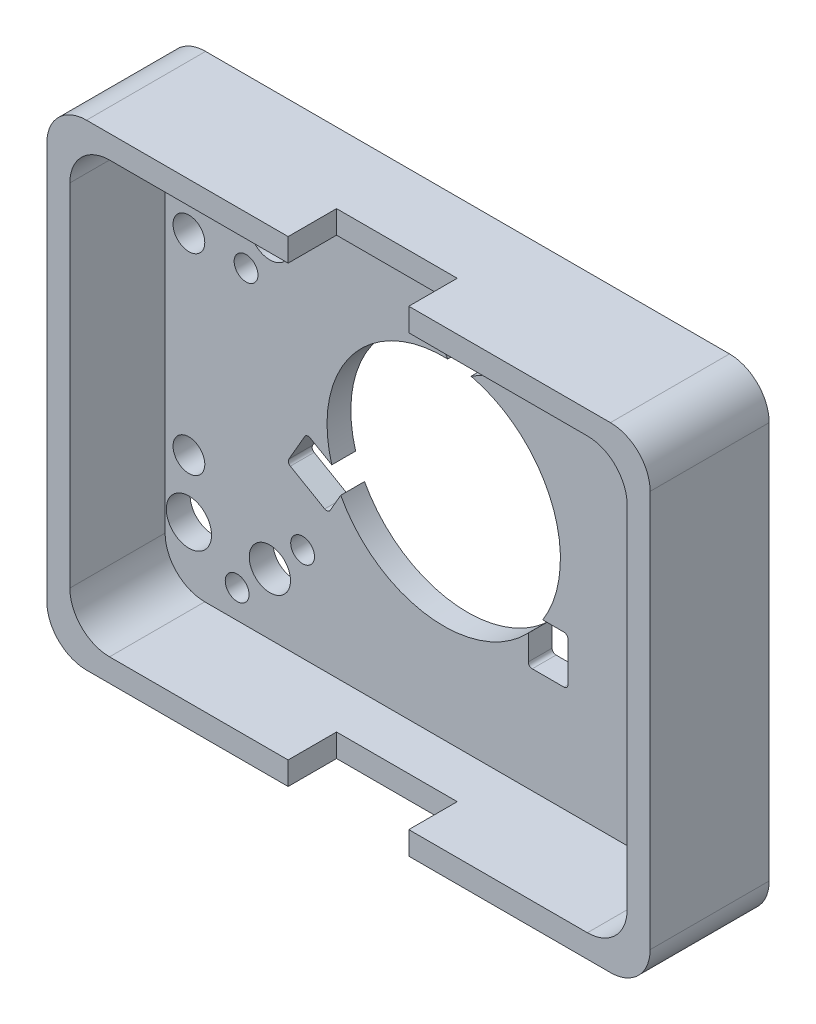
ISO-10303-21;
HEADER;
FILE_DESCRIPTION(('STEP AP214'),'2;1');
FILE_NAME('part.step','',(''),(''),'','','');
FILE_SCHEMA(('AUTOMOTIVE_DESIGN { 1 0 10303 214 1 1 1 1 }'));
ENDSEC;
DATA;
#1=APPLICATION_CONTEXT('core data for automotive mechanical design processes');
#2=APPLICATION_PROTOCOL_DEFINITION('international standard','automotive_design',2000,#1);
#3=PRODUCT_CONTEXT('',#1,'mechanical');
#4=PRODUCT('Part','Part','',(#3));
#5=PRODUCT_RELATED_PRODUCT_CATEGORY('part','',(#4));
#6=PRODUCT_DEFINITION_FORMATION('','',#4);
#7=PRODUCT_DEFINITION_CONTEXT('part definition',#1,'design');
#8=PRODUCT_DEFINITION('design','',#6,#7);
#9=PRODUCT_DEFINITION_SHAPE('','',#8);
#10=(LENGTH_UNIT() NAMED_UNIT(*) SI_UNIT(.MILLI.,.METRE.));
#11=(NAMED_UNIT(*) PLANE_ANGLE_UNIT() SI_UNIT($,.RADIAN.));
#12=(NAMED_UNIT(*) SI_UNIT($,.STERADIAN.) SOLID_ANGLE_UNIT());
#13=UNCERTAINTY_MEASURE_WITH_UNIT(LENGTH_MEASURE(1.E-05),#10,'distance_accuracy_value','');
#14=(GEOMETRIC_REPRESENTATION_CONTEXT(3) GLOBAL_UNCERTAINTY_ASSIGNED_CONTEXT((#13)) GLOBAL_UNIT_ASSIGNED_CONTEXT((#10,
#11,#12)) REPRESENTATION_CONTEXT('',''));
#15=CARTESIAN_POINT('',(0.,0.,0.));
#16=DIRECTION('',(0.,0.,1.));
#17=DIRECTION('',(1.,0.,0.));
#18=AXIS2_PLACEMENT_3D('',#15,#16,#17);
#19=CARTESIAN_POINT('',(-33.,-25.,0.));
#20=DIRECTION('',(0.,0.,1.));
#21=DIRECTION('',(1.,0.,0.));
#22=AXIS2_PLACEMENT_3D('',#19,#20,#21);
#23=PLANE('',#22);
#24=CARTESIAN_POINT('',(-26.0231056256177,-23.5231056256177,0.));
#25=DIRECTION('',(0.,0.,-1.));
#26=DIRECTION('',(1.,0.,0.));
#27=AXIS2_PLACEMENT_3D('',#24,#25,#26);
#28=CIRCLE('',#27,1.5);
#29=CARTESIAN_POINT('',(-27.5231056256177,-23.5231056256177,0.));
#30=VERTEX_POINT('',#29);
#31=EDGE_CURVE('E1770',#30,#30,#28,.T.);
#32=ORIENTED_EDGE('',*,*,#31,.F.);
#33=EDGE_LOOP('',(#32));
#34=FACE_BOUND('',#33,.T.);
#35=CARTESIAN_POINT('',(-18.9,21.9,0.));
#36=DIRECTION('',(0.,0.,-1.));
#37=DIRECTION('',(1.,0.,0.));
#38=AXIS2_PLACEMENT_3D('',#35,#36,#37);
#39=CIRCLE('',#38,1.5);
#40=CARTESIAN_POINT('',(-20.4,21.9,0.));
#41=VERTEX_POINT('',#40);
#42=EDGE_CURVE('E1777',#41,#41,#39,.T.);
#43=ORIENTED_EDGE('',*,*,#42,.F.);
#44=EDGE_LOOP('',(#43));
#45=FACE_BOUND('',#44,.T.);
#46=CARTESIAN_POINT('',(-24.9,11.9,0.));
#47=DIRECTION('',(0.,0.,-1.));
#48=DIRECTION('',(1.,0.,0.));
#49=AXIS2_PLACEMENT_3D('',#46,#47,#48);
#50=CIRCLE('',#49,1.5);
#51=CARTESIAN_POINT('',(-26.4,11.9,0.));
#52=VERTEX_POINT('',#51);
#53=EDGE_CURVE('E1758',#52,#52,#50,.T.);
#54=ORIENTED_EDGE('',*,*,#53,.F.);
#55=EDGE_LOOP('',(#54));
#56=FACE_BOUND('',#55,.T.);
#57=CARTESIAN_POINT('',(24.9,11.9,0.));
#58=DIRECTION('',(0.,0.,-1.));
#59=DIRECTION('',(-1.,0.,0.));
#60=AXIS2_PLACEMENT_3D('',#57,#58,#59);
#61=CIRCLE('',#60,1.5);
#62=CARTESIAN_POINT('',(23.4,11.9,0.));
#63=VERTEX_POINT('',#62);
#64=EDGE_CURVE('E1765',#63,#63,#61,.T.);
#65=ORIENTED_EDGE('',*,*,#64,.F.);
#66=EDGE_LOOP('',(#65));
#67=FACE_BOUND('',#66,.T.);
#68=CARTESIAN_POINT('',(-17.7768943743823,-15.2768943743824,0.));
#69=DIRECTION('',(0.,0.,-1.));
#70=DIRECTION('',(1.,0.,0.));
#71=AXIS2_PLACEMENT_3D('',#68,#69,#70);
#72=CIRCLE('',#71,1.5);
#73=CARTESIAN_POINT('',(-19.2768943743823,-15.2768943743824,0.));
#74=VERTEX_POINT('',#73);
#75=EDGE_CURVE('E1782',#74,#74,#72,.T.);
#76=ORIENTED_EDGE('',*,*,#75,.F.);
#77=EDGE_LOOP('',(#76));
#78=FACE_BOUND('',#77,.T.);
#79=CARTESIAN_POINT('',(18.9,21.9,0.));
#80=DIRECTION('',(0.,0.,-1.));
#81=DIRECTION('',(-1.,0.,0.));
#82=AXIS2_PLACEMENT_3D('',#79,#80,#81);
#83=CIRCLE('',#82,1.5);
#84=CARTESIAN_POINT('',(17.4,21.9,0.));
#85=VERTEX_POINT('',#84);
#86=EDGE_CURVE('E1738',#85,#85,#83,.T.);
#87=ORIENTED_EDGE('',*,*,#86,.F.);
#88=EDGE_LOOP('',(#87));
#89=FACE_BOUND('',#88,.T.);
#90=CARTESIAN_POINT('',(-21.9,-19.4,0.));
#91=DIRECTION('',(0.,0.,1.));
#92=DIRECTION('',(1.,0.,0.));
#93=AXIS2_PLACEMENT_3D('',#90,#91,#92);
#94=CIRCLE('',#93,2.6);
#95=CARTESIAN_POINT('',(-19.3,-19.4,0.));
#96=VERTEX_POINT('',#95);
#97=EDGE_CURVE('E404',#96,#96,#94,.T.);
#98=ORIENTED_EDGE('',*,*,#97,.T.);
#99=EDGE_LOOP('',(#98));
#100=FACE_BOUND('',#99,.T.);
#101=CARTESIAN_POINT('',(21.9,16.9,0.));
#102=DIRECTION('',(0.,0.,1.));
#103=DIRECTION('',(1.,0.,0.));
#104=AXIS2_PLACEMENT_3D('',#101,#102,#103);
#105=CIRCLE('',#104,2.6);
#106=CARTESIAN_POINT('',(24.5,16.9,0.));
#107=VERTEX_POINT('',#106);
#108=EDGE_CURVE('E1741',#107,#107,#105,.T.);
#109=ORIENTED_EDGE('',*,*,#108,.T.);
#110=EDGE_LOOP('',(#109));
#111=FACE_BOUND('',#110,.T.);
#112=CARTESIAN_POINT('',(-21.9,16.9,0.));
#113=DIRECTION('',(0.,0.,1.));
#114=DIRECTION('',(-1.,0.,0.));
#115=AXIS2_PLACEMENT_3D('',#112,#113,#114);
#116=CIRCLE('',#115,2.6);
#117=CARTESIAN_POINT('',(-24.5,16.9,0.));
#118=VERTEX_POINT('',#117);
#119=EDGE_CURVE('E1734',#118,#118,#116,.T.);
#120=ORIENTED_EDGE('',*,*,#119,.T.);
#121=EDGE_LOOP('',(#120));
#122=FACE_BOUND('',#121,.T.);
#123=CARTESIAN_POINT('',(-32.1,19.4,0.));
#124=DIRECTION('',(0.,0.,1.));
#125=DIRECTION('',(1.,0.,0.));
#126=AXIS2_PLACEMENT_3D('',#123,#124,#125);
#127=CIRCLE('',#126,2.85);
#128=CARTESIAN_POINT('',(-29.25,19.4,0.));
#129=VERTEX_POINT('',#128);
#130=EDGE_CURVE('E462',#129,#129,#127,.T.);
#131=ORIENTED_EDGE('',*,*,#130,.T.);
#132=EDGE_LOOP('',(#131));
#133=FACE_BOUND('',#132,.T.);
#134=CARTESIAN_POINT('',(32.1,-19.4,0.));
#135=DIRECTION('',(0.,0.,1.));
#136=DIRECTION('',(1.,0.,0.));
#137=AXIS2_PLACEMENT_3D('',#134,#135,#136);
#138=CIRCLE('',#137,2.85);
#139=CARTESIAN_POINT('',(34.95,-19.4,0.));
#140=VERTEX_POINT('',#139);
#141=EDGE_CURVE('E450',#140,#140,#138,.T.);
#142=ORIENTED_EDGE('',*,*,#141,.T.);
#143=EDGE_LOOP('',(#142));
#144=FACE_BOUND('',#143,.T.);
#145=CARTESIAN_POINT('',(32.1,17.9,0.));
#146=DIRECTION('',(0.,0.,1.));
#147=DIRECTION('',(1.,0.,0.));
#148=AXIS2_PLACEMENT_3D('',#145,#146,#147);
#149=CIRCLE('',#148,2.85);
#150=CARTESIAN_POINT('',(34.95,17.9,0.));
#151=VERTEX_POINT('',#150);
#152=EDGE_CURVE('E444',#151,#151,#149,.T.);
#153=ORIENTED_EDGE('',*,*,#152,.T.);
#154=EDGE_LOOP('',(#153));
#155=FACE_BOUND('',#154,.T.);
#156=CARTESIAN_POINT('',(-32.1,12.1,0.));
#157=DIRECTION('',(0.,0.,1.));
#158=DIRECTION('',(1.,0.,0.));
#159=AXIS2_PLACEMENT_3D('',#156,#157,#158);
#160=CIRCLE('',#159,2.);
#161=CARTESIAN_POINT('',(-30.1,12.1,0.));
#162=VERTEX_POINT('',#161);
#163=EDGE_CURVE('E470',#162,#162,#160,.T.);
#164=ORIENTED_EDGE('',*,*,#163,.T.);
#165=EDGE_LOOP('',(#164));
#166=FACE_BOUND('',#165,.T.);
#167=CARTESIAN_POINT('',(-33.,-25.,0.));
#168=DIRECTION('',(0.,0.,1.));
#169=DIRECTION('',(1.,0.,0.));
#170=AXIS2_PLACEMENT_3D('',#167,#168,#169);
#171=CIRCLE('',#170,5.);
#172=CARTESIAN_POINT('',(-38.,-25.,0.));
#173=VERTEX_POINT('',#172);
#174=CARTESIAN_POINT('',(-33.,-30.,0.));
#175=VERTEX_POINT('',#174);
#176=EDGE_CURVE('E694',#173,#175,#171,.T.);
#177=ORIENTED_EDGE('',*,*,#176,.F.);
#178=DIRECTION('',(0.,-1.,0.));
#179=VECTOR('',#178,1.);
#180=CARTESIAN_POINT('',(-38.,25.,0.));
#181=LINE('',#180,#179);
#182=CARTESIAN_POINT('',(-38.,25.,0.));
#183=VERTEX_POINT('',#182);
#184=EDGE_CURVE('E715',#183,#173,#181,.T.);
#185=ORIENTED_EDGE('',*,*,#184,.F.);
#186=CARTESIAN_POINT('',(-33.,25.,0.));
#187=DIRECTION('',(0.,0.,1.));
#188=DIRECTION('',(1.,0.,0.));
#189=AXIS2_PLACEMENT_3D('',#186,#187,#188);
#190=CIRCLE('',#189,5.);
#191=CARTESIAN_POINT('',(-33.,30.,0.));
#192=VERTEX_POINT('',#191);
#193=EDGE_CURVE('E746',#192,#183,#190,.T.);
#194=ORIENTED_EDGE('',*,*,#193,.F.);
#195=DIRECTION('',(-1.,0.,0.));
#196=VECTOR('',#195,1.);
#197=CARTESIAN_POINT('',(-33.,30.,0.));
#198=LINE('',#197,#196);
#199=CARTESIAN_POINT('',(33.,30.,0.));
#200=VERTEX_POINT('',#199);
#201=EDGE_CURVE('E744',#200,#192,#198,.T.);
#202=ORIENTED_EDGE('',*,*,#201,.F.);
#203=CARTESIAN_POINT('',(33.,25.,0.));
#204=DIRECTION('',(0.,0.,1.));
#205=DIRECTION('',(-1.,0.,0.));
#206=AXIS2_PLACEMENT_3D('',#203,#204,#205);
#207=CIRCLE('',#206,5.);
#208=CARTESIAN_POINT('',(38.,25.,0.));
#209=VERTEX_POINT('',#208);
#210=EDGE_CURVE('E742',#209,#200,#207,.T.);
#211=ORIENTED_EDGE('',*,*,#210,.F.);
#212=DIRECTION('',(0.,1.,0.));
#213=VECTOR('',#212,1.);
#214=CARTESIAN_POINT('',(38.,25.,0.));
#215=LINE('',#214,#213);
#216=CARTESIAN_POINT('',(38.,-25.,0.));
#217=VERTEX_POINT('',#216);
#218=EDGE_CURVE('E740',#217,#209,#215,.T.);
#219=ORIENTED_EDGE('',*,*,#218,.F.);
#220=CARTESIAN_POINT('',(33.,-25.,0.));
#221=DIRECTION('',(0.,0.,1.));
#222=DIRECTION('',(1.,0.,0.));
#223=AXIS2_PLACEMENT_3D('',#220,#221,#222);
#224=CIRCLE('',#223,5.);
#225=CARTESIAN_POINT('',(33.,-30.,0.));
#226=VERTEX_POINT('',#225);
#227=EDGE_CURVE('E738',#226,#217,#224,.T.);
#228=ORIENTED_EDGE('',*,*,#227,.F.);
#229=DIRECTION('',(1.,0.,0.));
#230=VECTOR('',#229,1.);
#231=CARTESIAN_POINT('',(-33.,-30.,0.));
#232=LINE('',#231,#230);
#233=EDGE_CURVE('E736',#175,#226,#232,.T.);
#234=ORIENTED_EDGE('',*,*,#233,.F.);
#235=EDGE_LOOP('',(#177,#185,#194,#202,#211,#219,#228,#234));
#236=FACE_BOUND('',#235,.T.);
#237=CARTESIAN_POINT('',(32.1,-12.1,0.));
#238=DIRECTION('',(0.,0.,1.));
#239=DIRECTION('',(1.,0.,0.));
#240=AXIS2_PLACEMENT_3D('',#237,#238,#239);
#241=CIRCLE('',#240,2.);
#242=CARTESIAN_POINT('',(34.1,-12.1,0.));
#243=VERTEX_POINT('',#242);
#244=EDGE_CURVE('E1728',#243,#243,#241,.T.);
#245=ORIENTED_EDGE('',*,*,#244,.T.);
#246=EDGE_LOOP('',(#245));
#247=FACE_BOUND('',#246,.T.);
#248=DIRECTION('',(1.,0.,0.));
#249=VECTOR('',#248,1.);
#250=CARTESIAN_POINT('',(11.15,-7.78,0.));
#251=LINE('',#250,#249);
#252=CARTESIAN_POINT('',(12.4724336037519,-7.78,0.));
#253=VERTEX_POINT('',#252);
#254=CARTESIAN_POINT('',(15.15,-7.78,0.));
#255=VERTEX_POINT('',#254);
#256=EDGE_CURVE('E477',#253,#255,#251,.T.);
#257=ORIENTED_EDGE('',*,*,#256,.F.);
#258=CARTESIAN_POINT('',(0.,0.,0.));
#259=DIRECTION('',(0.,0.,-1.));
#260=DIRECTION('',(-1.,0.,0.));
#261=AXIS2_PLACEMENT_3D('',#258,#259,#260);
#262=CIRCLE('',#261,14.7);
#263=CARTESIAN_POINT('',(3.44999999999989,14.2894191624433,0.));
#264=VERTEX_POINT('',#263);
#265=EDGE_CURVE('E636',#264,#253,#262,.T.);
#266=ORIENTED_EDGE('',*,*,#265,.F.);
#267=DIRECTION('',(-0.866025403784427,-0.500000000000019,0.));
#268=VECTOR('',#267,1.);
#269=CARTESIAN_POINT('',(-5.32500000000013,9.22317055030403,0.));
#270=LINE('',#269,#268);
#271=CARTESIAN_POINT('',(6.17581736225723,15.8631705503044,0.));
#272=VERTEX_POINT('',#271);
#273=EDGE_CURVE('E550',#272,#264,#270,.T.);
#274=ORIENTED_EDGE('',*,*,#273,.F.);
#275=CARTESIAN_POINT('',(5.92581736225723,16.2961832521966,0.));
#276=DIRECTION('',(0.,0.,1.));
#277=DIRECTION('',(1.,0.,0.));
#278=AXIS2_PLACEMENT_3D('',#275,#276,#277);
#279=CIRCLE('',#278,0.499999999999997);
#280=CARTESIAN_POINT('',(6.35883006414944,16.5461832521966,0.));
#281=VERTEX_POINT('',#280);
#282=EDGE_CURVE('E535',#281,#272,#279,.F.);
#283=ORIENTED_EDGE('',*,*,#282,.F.);
#284=DIRECTION('',(0.500000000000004,-0.866025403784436,0.));
#285=VECTOR('',#284,1.);
#286=CARTESIAN_POINT('',(11.9338300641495,6.89000000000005,0.));
#287=LINE('',#286,#285);
#288=CARTESIAN_POINT('',(4.35883006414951,20.0102848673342,0.));
#289=VERTEX_POINT('',#288);
#290=EDGE_CURVE('E537',#289,#281,#287,.T.);
#291=ORIENTED_EDGE('',*,*,#290,.F.);
#292=CARTESIAN_POINT('',(3.92581736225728,19.7602848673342,0.));
#293=DIRECTION('',(0.,0.,1.));
#294=DIRECTION('',(1.,0.,0.));
#295=AXIS2_PLACEMENT_3D('',#292,#293,#294);
#296=CIRCLE('',#295,0.500000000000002);
#297=CARTESIAN_POINT('',(3.6758173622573,20.1932975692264,0.));
#298=VERTEX_POINT('',#297);
#299=EDGE_CURVE('E540',#298,#289,#296,.F.);
#300=ORIENTED_EDGE('',*,*,#299,.F.);
#301=DIRECTION('',(0.866025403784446,0.499999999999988,0.));
#302=VECTOR('',#301,1.);
#303=CARTESIAN_POINT('',(-7.82499999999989,13.5532975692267,0.));
#304=LINE('',#303,#302);
#305=CARTESIAN_POINT('',(-0.65430965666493,17.6932975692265,0.));
#306=VERTEX_POINT('',#305);
#307=EDGE_CURVE('E542',#306,#298,#304,.T.);
#308=ORIENTED_EDGE('',*,*,#307,.F.);
#309=CARTESIAN_POINT('',(-0.404309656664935,17.2602848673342,0.));
#310=DIRECTION('',(0.,0.,1.));
#311=DIRECTION('',(1.,0.,0.));
#312=AXIS2_PLACEMENT_3D('',#309,#310,#311);
#313=CIRCLE('',#312,0.499999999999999);
#314=CARTESIAN_POINT('',(-0.837322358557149,17.0102848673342,0.));
#315=VERTEX_POINT('',#314);
#316=EDGE_CURVE('E544',#306,#315,#313,.T.);
#317=ORIENTED_EDGE('',*,*,#316,.T.);
#318=DIRECTION('',(0.500000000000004,-0.866025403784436,0.));
#319=VECTOR('',#318,1.);
#320=CARTESIAN_POINT('',(6.73767764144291,3.89000000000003,0.));
#321=LINE('',#320,#319);
#322=CARTESIAN_POINT('',(0.501460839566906,14.6914443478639,0.));
#323=VERTEX_POINT('',#322);
#324=EDGE_CURVE('E547',#315,#323,#321,.T.);
#325=ORIENTED_EDGE('',*,*,#324,.T.);
#326=CARTESIAN_POINT('',(-14.0999999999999,-4.15692193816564,0.));
#327=VERTEX_POINT('',#326);
#328=EDGE_CURVE('E602',#327,#323,#262,.T.);
#329=ORIENTED_EDGE('',*,*,#328,.F.);
#330=DIRECTION('',(0.866025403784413,-0.500000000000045,0.));
#331=VECTOR('',#330,1.);
#332=CARTESIAN_POINT('',(-16.8258173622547,-2.58317055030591,0.));
#333=LINE('',#332,#331);
#334=CARTESIAN_POINT('',(-16.8258173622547,-2.58317055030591,0.));
#335=VERTEX_POINT('',#334);
#336=EDGE_CURVE('E419',#335,#327,#333,.T.);
#337=ORIENTED_EDGE('',*,*,#336,.F.);
#338=CARTESIAN_POINT('',(-17.0758173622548,-3.01618325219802,0.));
#339=DIRECTION('',(0.,0.,1.));
#340=DIRECTION('',(1.,0.,0.));
#341=AXIS2_PLACEMENT_3D('',#338,#339,#340);
#342=CIRCLE('',#341,0.499999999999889);
#343=CARTESIAN_POINT('',(-17.5088300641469,-2.76618325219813,0.));
#344=VERTEX_POINT('',#343);
#345=EDGE_CURVE('E433',#335,#344,#342,.T.);
#346=ORIENTED_EDGE('',*,*,#345,.T.);
#347=DIRECTION('',(-0.499999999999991,-0.866025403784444,0.));
#348=VECTOR('',#347,1.);
#349=CARTESIAN_POINT('',(-11.933830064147,6.88999999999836,0.));
#350=LINE('',#349,#348);
#351=CARTESIAN_POINT('',(-19.5088300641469,-6.23028486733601,0.));
#352=VERTEX_POINT('',#351);
#353=EDGE_CURVE('E429',#344,#352,#350,.T.);
#354=ORIENTED_EDGE('',*,*,#353,.T.);
#355=CARTESIAN_POINT('',(-19.0758173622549,-6.48028486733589,0.));
#356=DIRECTION('',(0.,0.,1.));
#357=DIRECTION('',(1.,0.,0.));
#358=AXIS2_PLACEMENT_3D('',#355,#356,#357);
#359=CIRCLE('',#358,0.499999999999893);
#360=CARTESIAN_POINT('',(-19.3258173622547,-6.91329756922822,0.));
#361=VERTEX_POINT('',#360);
#362=EDGE_CURVE('E427',#352,#361,#359,.T.);
#363=ORIENTED_EDGE('',*,*,#362,.T.);
#364=DIRECTION('',(0.866025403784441,-0.499999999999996,0.));
#365=VECTOR('',#364,1.);
#366=CARTESIAN_POINT('',(-7.82500000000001,-13.5532975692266,0.));
#367=LINE('',#366,#365);
#368=CARTESIAN_POINT('',(-14.9956903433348,-9.41329756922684,0.));
#369=VERTEX_POINT('',#368);
#370=EDGE_CURVE('E399',#361,#369,#367,.T.);
#371=ORIENTED_EDGE('',*,*,#370,.T.);
#372=CARTESIAN_POINT('',(-14.7456903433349,-8.98028486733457,0.));
#373=DIRECTION('',(0.,0.,1.));
#374=DIRECTION('',(1.,0.,0.));
#375=AXIS2_PLACEMENT_3D('',#372,#373,#374);
#376=CIRCLE('',#375,0.500000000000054);
#377=CARTESIAN_POINT('',(-14.3126776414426,-9.23028486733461,0.));
#378=VERTEX_POINT('',#377);
#379=EDGE_CURVE('E436',#369,#378,#376,.T.);
#380=ORIENTED_EDGE('',*,*,#379,.T.);
#381=DIRECTION('',(-0.499999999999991,-0.866025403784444,0.));
#382=VECTOR('',#381,1.);
#383=CARTESIAN_POINT('',(-12.3126776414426,-5.7661832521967,0.));
#384=LINE('',#383,#382);
#385=CARTESIAN_POINT('',(-12.9738944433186,-6.91144434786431,0.));
#386=VERTEX_POINT('',#385);
#387=EDGE_CURVE('E421',#386,#378,#384,.T.);
#388=ORIENTED_EDGE('',*,*,#387,.F.);
#389=CARTESIAN_POINT('',(10.65,-10.1324972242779,0.));
#390=VERTEX_POINT('',#389);
#391=EDGE_CURVE('E635',#390,#386,#262,.T.);
#392=ORIENTED_EDGE('',*,*,#391,.F.);
#393=DIRECTION('',(0.,-1.,0.));
#394=VECTOR('',#393,1.);
#395=CARTESIAN_POINT('',(10.65,-8.28,0.));
#396=LINE('',#395,#394);
#397=CARTESIAN_POINT('',(10.65,-13.28,0.));
#398=VERTEX_POINT('',#397);
#399=EDGE_CURVE('E491',#390,#398,#396,.T.);
#400=ORIENTED_EDGE('',*,*,#399,.T.);
#401=CARTESIAN_POINT('',(11.15,-13.28,0.));
#402=DIRECTION('',(0.,0.,1.));
#403=DIRECTION('',(1.,0.,0.));
#404=AXIS2_PLACEMENT_3D('',#401,#402,#403);
#405=CIRCLE('',#404,0.5);
#406=CARTESIAN_POINT('',(11.15,-13.78,0.));
#407=VERTEX_POINT('',#406);
#408=EDGE_CURVE('E518',#398,#407,#405,.T.);
#409=ORIENTED_EDGE('',*,*,#408,.T.);
#410=DIRECTION('',(-1.,0.,0.));
#411=VECTOR('',#410,1.);
#412=CARTESIAN_POINT('',(15.15,-13.78,0.));
#413=LINE('',#412,#411);
#414=CARTESIAN_POINT('',(15.15,-13.78,0.));
#415=VERTEX_POINT('',#414);
#416=EDGE_CURVE('E516',#415,#407,#413,.T.);
#417=ORIENTED_EDGE('',*,*,#416,.F.);
#418=CARTESIAN_POINT('',(15.15,-13.28,0.));
#419=DIRECTION('',(0.,0.,1.));
#420=DIRECTION('',(1.,0.,0.));
#421=AXIS2_PLACEMENT_3D('',#418,#419,#420);
#422=CIRCLE('',#421,0.5);
#423=CARTESIAN_POINT('',(15.65,-13.28,0.));
#424=VERTEX_POINT('',#423);
#425=EDGE_CURVE('E513',#415,#424,#422,.T.);
#426=ORIENTED_EDGE('',*,*,#425,.T.);
#427=DIRECTION('',(0.,-1.,0.));
#428=VECTOR('',#427,1.);
#429=CARTESIAN_POINT('',(15.65,-8.28,0.));
#430=LINE('',#429,#428);
#431=CARTESIAN_POINT('',(15.65,-8.28,0.));
#432=VERTEX_POINT('',#431);
#433=EDGE_CURVE('E511',#432,#424,#430,.T.);
#434=ORIENTED_EDGE('',*,*,#433,.F.);
#435=CARTESIAN_POINT('',(15.15,-8.28,0.));
#436=DIRECTION('',(0.,0.,1.));
#437=DIRECTION('',(1.,0.,0.));
#438=AXIS2_PLACEMENT_3D('',#435,#436,#437);
#439=CIRCLE('',#438,0.499999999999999);
#440=EDGE_CURVE('E508',#432,#255,#439,.T.);
#441=ORIENTED_EDGE('',*,*,#440,.T.);
#442=EDGE_LOOP('',(#257,#266,#274,#283,#291,#300,#308,#317,#325,#329,#337,#346,#354,#363,#371,
#380,#388,#392,#400,#409,#417,#426,#434,#441));
#443=FACE_BOUND('',#442,.T.);
#444=CARTESIAN_POINT('',(-32.1,-12.1,0.));
#445=DIRECTION('',(0.,0.,-1.));
#446=DIRECTION('',(-1.,0.,0.));
#447=AXIS2_PLACEMENT_3D('',#444,#445,#446);
#448=CIRCLE('',#447,2.);
#449=CARTESIAN_POINT('',(-34.1,-12.1,0.));
#450=VERTEX_POINT('',#449);
#451=EDGE_CURVE('E469',#450,#450,#448,.T.);
#452=ORIENTED_EDGE('',*,*,#451,.F.);
#453=EDGE_LOOP('',(#452));
#454=FACE_BOUND('',#453,.T.);
#455=CARTESIAN_POINT('',(32.1,12.1,0.));
#456=DIRECTION('',(0.,0.,-1.));
#457=DIRECTION('',(-1.,0.,0.));
#458=AXIS2_PLACEMENT_3D('',#455,#456,#457);
#459=CIRCLE('',#458,2.);
#460=CARTESIAN_POINT('',(30.1,12.1,0.));
#461=VERTEX_POINT('',#460);
#462=EDGE_CURVE('E527',#461,#461,#459,.T.);
#463=ORIENTED_EDGE('',*,*,#462,.F.);
#464=EDGE_LOOP('',(#463));
#465=FACE_BOUND('',#464,.T.);
#466=CARTESIAN_POINT('',(-32.1,-19.4,0.));
#467=DIRECTION('',(0.,0.,-1.));
#468=DIRECTION('',(-1.,0.,0.));
#469=AXIS2_PLACEMENT_3D('',#466,#467,#468);
#470=CIRCLE('',#469,2.85);
#471=CARTESIAN_POINT('',(-34.95,-19.4,0.));
#472=VERTEX_POINT('',#471);
#473=EDGE_CURVE('E456',#472,#472,#470,.T.);
#474=ORIENTED_EDGE('',*,*,#473,.F.);
#475=EDGE_LOOP('',(#474));
#476=FACE_BOUND('',#475,.T.);
#477=ADVANCED_FACE('F87',(#34,#45,#56,#67,#78,#89,#100,#111,#122,#133,#144,#155,#166,#236,#247,
#443,#454,#465,#476),#23,.F.);
#478=CARTESIAN_POINT('',(-30.1,-22.1,3.));
#479=DIRECTION('',(0.,0.,1.));
#480=DIRECTION('',(1.,0.,0.));
#481=AXIS2_PLACEMENT_3D('',#478,#479,#480);
#482=PLANE('',#481);
#483=CARTESIAN_POINT('',(-26.0231056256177,-23.5231056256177,3.));
#484=DIRECTION('',(0.,0.,1.));
#485=DIRECTION('',(1.,0.,0.));
#486=AXIS2_PLACEMENT_3D('',#483,#484,#485);
#487=CIRCLE('',#486,1.5);
#488=CARTESIAN_POINT('',(-27.5231056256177,-23.5231056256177,3.));
#489=VERTEX_POINT('',#488);
#490=EDGE_CURVE('E1773',#489,#489,#487,.F.);
#491=ORIENTED_EDGE('',*,*,#490,.T.);
#492=EDGE_LOOP('',(#491));
#493=FACE_BOUND('',#492,.T.);
#494=CARTESIAN_POINT('',(-18.9,21.9,3.));
#495=DIRECTION('',(0.,0.,1.));
#496=DIRECTION('',(1.,0.,0.));
#497=AXIS2_PLACEMENT_3D('',#494,#495,#496);
#498=CIRCLE('',#497,1.5);
#499=CARTESIAN_POINT('',(-20.4,21.9,3.));
#500=VERTEX_POINT('',#499);
#501=EDGE_CURVE('E1762',#500,#500,#498,.F.);
#502=ORIENTED_EDGE('',*,*,#501,.T.);
#503=EDGE_LOOP('',(#502));
#504=FACE_BOUND('',#503,.T.);
#505=CARTESIAN_POINT('',(-24.9,11.9,3.));
#506=DIRECTION('',(0.,0.,1.));
#507=DIRECTION('',(1.,0.,0.));
#508=AXIS2_PLACEMENT_3D('',#505,#506,#507);
#509=CIRCLE('',#508,1.5);
#510=CARTESIAN_POINT('',(-26.4,11.9,3.));
#511=VERTEX_POINT('',#510);
#512=EDGE_CURVE('E1761',#511,#511,#509,.F.);
#513=ORIENTED_EDGE('',*,*,#512,.T.);
#514=EDGE_LOOP('',(#513));
#515=FACE_BOUND('',#514,.T.);
#516=CARTESIAN_POINT('',(24.9,11.9,3.));
#517=DIRECTION('',(0.,0.,1.));
#518=DIRECTION('',(1.,0.,0.));
#519=AXIS2_PLACEMENT_3D('',#516,#517,#518);
#520=CIRCLE('',#519,1.5);
#521=CARTESIAN_POINT('',(23.4,11.9,3.));
#522=VERTEX_POINT('',#521);
#523=EDGE_CURVE('E1755',#522,#522,#520,.F.);
#524=ORIENTED_EDGE('',*,*,#523,.T.);
#525=EDGE_LOOP('',(#524));
#526=FACE_BOUND('',#525,.T.);
#527=CARTESIAN_POINT('',(-17.7768943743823,-15.2768943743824,3.));
#528=DIRECTION('',(0.,0.,1.));
#529=DIRECTION('',(1.,0.,0.));
#530=AXIS2_PLACEMENT_3D('',#527,#528,#529);
#531=CIRCLE('',#530,1.5);
#532=CARTESIAN_POINT('',(-19.2768943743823,-15.2768943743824,3.));
#533=VERTEX_POINT('',#532);
#534=EDGE_CURVE('E1774',#533,#533,#531,.F.);
#535=ORIENTED_EDGE('',*,*,#534,.T.);
#536=EDGE_LOOP('',(#535));
#537=FACE_BOUND('',#536,.T.);
#538=CARTESIAN_POINT('',(18.9,21.9,3.));
#539=DIRECTION('',(0.,0.,1.));
#540=DIRECTION('',(1.,0.,0.));
#541=AXIS2_PLACEMENT_3D('',#538,#539,#540);
#542=CIRCLE('',#541,1.5);
#543=CARTESIAN_POINT('',(17.4,21.9,3.));
#544=VERTEX_POINT('',#543);
#545=EDGE_CURVE('E1752',#544,#544,#542,.F.);
#546=ORIENTED_EDGE('',*,*,#545,.T.);
#547=EDGE_LOOP('',(#546));
#548=FACE_BOUND('',#547,.T.);
#549=CARTESIAN_POINT('',(-21.9,-19.4,3.));
#550=DIRECTION('',(0.,0.,1.));
#551=DIRECTION('',(1.,0.,0.));
#552=AXIS2_PLACEMENT_3D('',#549,#550,#551);
#553=CIRCLE('',#552,2.6);
#554=CARTESIAN_POINT('',(-19.3,-19.4,3.));
#555=VERTEX_POINT('',#554);
#556=EDGE_CURVE('E1747',#555,#555,#553,.T.);
#557=ORIENTED_EDGE('',*,*,#556,.F.);
#558=EDGE_LOOP('',(#557));
#559=FACE_BOUND('',#558,.T.);
#560=CARTESIAN_POINT('',(21.9,16.9,3.));
#561=DIRECTION('',(0.,0.,1.));
#562=DIRECTION('',(1.,0.,0.));
#563=AXIS2_PLACEMENT_3D('',#560,#561,#562);
#564=CIRCLE('',#563,2.6);
#565=CARTESIAN_POINT('',(24.5,16.9,3.));
#566=VERTEX_POINT('',#565);
#567=EDGE_CURVE('E1744',#566,#566,#564,.T.);
#568=ORIENTED_EDGE('',*,*,#567,.F.);
#569=EDGE_LOOP('',(#568));
#570=FACE_BOUND('',#569,.T.);
#571=CARTESIAN_POINT('',(-21.9,16.9,3.));
#572=DIRECTION('',(0.,0.,1.));
#573=DIRECTION('',(-1.,0.,0.));
#574=AXIS2_PLACEMENT_3D('',#571,#572,#573);
#575=CIRCLE('',#574,2.6);
#576=CARTESIAN_POINT('',(-24.5,16.9,3.));
#577=VERTEX_POINT('',#576);
#578=EDGE_CURVE('E1737',#577,#577,#575,.T.);
#579=ORIENTED_EDGE('',*,*,#578,.F.);
#580=EDGE_LOOP('',(#579));
#581=FACE_BOUND('',#580,.T.);
#582=CARTESIAN_POINT('',(-32.1,19.4,3.));
#583=DIRECTION('',(0.,0.,1.));
#584=DIRECTION('',(1.,0.,0.));
#585=AXIS2_PLACEMENT_3D('',#582,#583,#584);
#586=CIRCLE('',#585,2.85);
#587=CARTESIAN_POINT('',(-29.25,19.4,3.));
#588=VERTEX_POINT('',#587);
#589=EDGE_CURVE('E459',#588,#588,#586,.T.);
#590=ORIENTED_EDGE('',*,*,#589,.F.);
#591=EDGE_LOOP('',(#590));
#592=FACE_BOUND('',#591,.T.);
#593=CARTESIAN_POINT('',(32.1,12.1,3.));
#594=DIRECTION('',(0.,0.,-1.));
#595=DIRECTION('',(-1.,0.,0.));
#596=AXIS2_PLACEMENT_3D('',#593,#594,#595);
#597=CIRCLE('',#596,2.);
#598=CARTESIAN_POINT('',(30.1,12.1,3.));
#599=VERTEX_POINT('',#598);
#600=EDGE_CURVE('E523',#599,#599,#597,.T.);
#601=ORIENTED_EDGE('',*,*,#600,.T.);
#602=EDGE_LOOP('',(#601));
#603=FACE_BOUND('',#602,.T.);
#604=CARTESIAN_POINT('',(0.,0.,2.99999999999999));
#605=DIRECTION('',(0.,0.,-1.));
#606=DIRECTION('',(-1.,0.,0.));
#607=AXIS2_PLACEMENT_3D('',#604,#605,#606);
#608=CIRCLE('',#607,14.7);
#609=CARTESIAN_POINT('',(3.44999999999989,14.2894191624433,3.));
#610=VERTEX_POINT('',#609);
#611=CARTESIAN_POINT('',(12.4724336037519,-7.78,3.));
#612=VERTEX_POINT('',#611);
#613=EDGE_CURVE('E641',#610,#612,#608,.T.);
#614=ORIENTED_EDGE('',*,*,#613,.T.);
#615=DIRECTION('',(1.,0.,0.));
#616=VECTOR('',#615,1.);
#617=CARTESIAN_POINT('',(11.15,-7.78,3.));
#618=LINE('',#617,#616);
#619=CARTESIAN_POINT('',(15.15,-7.78,3.));
#620=VERTEX_POINT('',#619);
#621=EDGE_CURVE('E487',#612,#620,#618,.T.);
#622=ORIENTED_EDGE('',*,*,#621,.T.);
#623=CARTESIAN_POINT('',(15.15,-8.28,3.));
#624=DIRECTION('',(0.,0.,1.));
#625=DIRECTION('',(1.,0.,0.));
#626=AXIS2_PLACEMENT_3D('',#623,#624,#625);
#627=CIRCLE('',#626,0.499999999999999);
#628=CARTESIAN_POINT('',(15.65,-8.28,3.));
#629=VERTEX_POINT('',#628);
#630=EDGE_CURVE('E490',#629,#620,#627,.T.);
#631=ORIENTED_EDGE('',*,*,#630,.F.);
#632=DIRECTION('',(0.,-1.,0.));
#633=VECTOR('',#632,1.);
#634=CARTESIAN_POINT('',(15.65,-8.28,3.));
#635=LINE('',#634,#633);
#636=CARTESIAN_POINT('',(15.65,-13.28,3.));
#637=VERTEX_POINT('',#636);
#638=EDGE_CURVE('E494',#629,#637,#635,.T.);
#639=ORIENTED_EDGE('',*,*,#638,.T.);
#640=CARTESIAN_POINT('',(15.15,-13.28,3.));
#641=DIRECTION('',(0.,0.,1.));
#642=DIRECTION('',(1.,0.,0.));
#643=AXIS2_PLACEMENT_3D('',#640,#641,#642);
#644=CIRCLE('',#643,0.5);
#645=CARTESIAN_POINT('',(15.15,-13.78,3.));
#646=VERTEX_POINT('',#645);
#647=EDGE_CURVE('E497',#646,#637,#644,.T.);
#648=ORIENTED_EDGE('',*,*,#647,.F.);
#649=DIRECTION('',(-1.,0.,0.));
#650=VECTOR('',#649,1.);
#651=CARTESIAN_POINT('',(15.15,-13.78,3.));
#652=LINE('',#651,#650);
#653=CARTESIAN_POINT('',(11.15,-13.78,3.));
#654=VERTEX_POINT('',#653);
#655=EDGE_CURVE('E500',#646,#654,#652,.T.);
#656=ORIENTED_EDGE('',*,*,#655,.T.);
#657=CARTESIAN_POINT('',(11.15,-13.28,3.));
#658=DIRECTION('',(0.,0.,1.));
#659=DIRECTION('',(1.,0.,0.));
#660=AXIS2_PLACEMENT_3D('',#657,#658,#659);
#661=CIRCLE('',#660,0.5);
#662=CARTESIAN_POINT('',(10.65,-13.28,3.));
#663=VERTEX_POINT('',#662);
#664=EDGE_CURVE('E503',#663,#654,#661,.T.);
#665=ORIENTED_EDGE('',*,*,#664,.F.);
#666=DIRECTION('',(0.,-1.,0.));
#667=VECTOR('',#666,1.);
#668=CARTESIAN_POINT('',(10.65,-8.28,3.));
#669=LINE('',#668,#667);
#670=CARTESIAN_POINT('',(10.65,-10.1324972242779,3.));
#671=VERTEX_POINT('',#670);
#672=EDGE_CURVE('E473',#671,#663,#669,.T.);
#673=ORIENTED_EDGE('',*,*,#672,.F.);
#674=CARTESIAN_POINT('',(-12.9738944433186,-6.91144434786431,3.));
#675=VERTEX_POINT('',#674);
#676=EDGE_CURVE('E640',#671,#675,#608,.T.);
#677=ORIENTED_EDGE('',*,*,#676,.T.);
#678=DIRECTION('',(-0.499999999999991,-0.866025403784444,0.));
#679=VECTOR('',#678,1.);
#680=CARTESIAN_POINT('',(-12.3126776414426,-5.7661832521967,3.));
#681=LINE('',#680,#679);
#682=CARTESIAN_POINT('',(-14.3126776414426,-9.23028486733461,3.));
#683=VERTEX_POINT('',#682);
#684=EDGE_CURVE('E102',#675,#683,#681,.T.);
#685=ORIENTED_EDGE('',*,*,#684,.T.);
#686=CARTESIAN_POINT('',(-14.7456903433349,-8.98028486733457,3.));
#687=DIRECTION('',(0.,0.,1.));
#688=DIRECTION('',(1.,0.,0.));
#689=AXIS2_PLACEMENT_3D('',#686,#687,#688);
#690=CIRCLE('',#689,0.500000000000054);
#691=CARTESIAN_POINT('',(-14.9956903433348,-9.41329756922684,3.));
#692=VERTEX_POINT('',#691);
#693=EDGE_CURVE('E418',#692,#683,#690,.T.);
#694=ORIENTED_EDGE('',*,*,#693,.F.);
#695=DIRECTION('',(0.866025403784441,-0.499999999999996,0.));
#696=VECTOR('',#695,1.);
#697=CARTESIAN_POINT('',(-7.82500000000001,-13.5532975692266,3.));
#698=LINE('',#697,#696);
#699=CARTESIAN_POINT('',(-19.3258173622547,-6.91329756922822,3.));
#700=VERTEX_POINT('',#699);
#701=EDGE_CURVE('E396',#700,#692,#698,.T.);
#702=ORIENTED_EDGE('',*,*,#701,.F.);
#703=CARTESIAN_POINT('',(-19.0758173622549,-6.48028486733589,3.));
#704=DIRECTION('',(0.,0.,1.));
#705=DIRECTION('',(1.,0.,0.));
#706=AXIS2_PLACEMENT_3D('',#703,#704,#705);
#707=CIRCLE('',#706,0.499999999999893);
#708=CARTESIAN_POINT('',(-19.5088300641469,-6.23028486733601,3.));
#709=VERTEX_POINT('',#708);
#710=EDGE_CURVE('E407',#709,#700,#707,.T.);
#711=ORIENTED_EDGE('',*,*,#710,.F.);
#712=DIRECTION('',(-0.499999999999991,-0.866025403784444,0.));
#713=VECTOR('',#712,1.);
#714=CARTESIAN_POINT('',(-11.933830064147,6.88999999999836,3.));
#715=LINE('',#714,#713);
#716=CARTESIAN_POINT('',(-17.5088300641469,-2.76618325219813,3.));
#717=VERTEX_POINT('',#716);
#718=EDGE_CURVE('E412',#717,#709,#715,.T.);
#719=ORIENTED_EDGE('',*,*,#718,.F.);
#720=CARTESIAN_POINT('',(-17.0758173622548,-3.01618325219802,3.));
#721=DIRECTION('',(0.,0.,1.));
#722=DIRECTION('',(1.,0.,0.));
#723=AXIS2_PLACEMENT_3D('',#720,#721,#722);
#724=CIRCLE('',#723,0.499999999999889);
#725=CARTESIAN_POINT('',(-16.8258173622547,-2.58317055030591,3.));
#726=VERTEX_POINT('',#725);
#727=EDGE_CURVE('E423',#726,#717,#724,.T.);
#728=ORIENTED_EDGE('',*,*,#727,.F.);
#729=DIRECTION('',(0.866025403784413,-0.500000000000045,0.));
#730=VECTOR('',#729,1.);
#731=CARTESIAN_POINT('',(-16.8258173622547,-2.58317055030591,3.));
#732=LINE('',#731,#730);
#733=CARTESIAN_POINT('',(-14.0999999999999,-4.15692193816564,3.));
#734=VERTEX_POINT('',#733);
#735=EDGE_CURVE('E828',#726,#734,#732,.T.);
#736=ORIENTED_EDGE('',*,*,#735,.T.);
#737=CARTESIAN_POINT('',(0.501460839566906,14.6914443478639,2.99999999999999));
#738=VERTEX_POINT('',#737);
#739=EDGE_CURVE('E637',#734,#738,#608,.T.);
#740=ORIENTED_EDGE('',*,*,#739,.T.);
#741=DIRECTION('',(0.500000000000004,-0.866025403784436,0.));
#742=VECTOR('',#741,1.);
#743=CARTESIAN_POINT('',(6.73767764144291,3.89000000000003,3.));
#744=LINE('',#743,#742);
#745=CARTESIAN_POINT('',(-0.837322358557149,17.0102848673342,3.));
#746=VERTEX_POINT('',#745);
#747=EDGE_CURVE('E110',#746,#738,#744,.T.);
#748=ORIENTED_EDGE('',*,*,#747,.F.);
#749=CARTESIAN_POINT('',(-0.404309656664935,17.2602848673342,3.));
#750=DIRECTION('',(0.,0.,1.));
#751=DIRECTION('',(1.,0.,0.));
#752=AXIS2_PLACEMENT_3D('',#749,#750,#751);
#753=CIRCLE('',#752,0.499999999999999);
#754=CARTESIAN_POINT('',(-0.65430965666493,17.6932975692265,3.));
#755=VERTEX_POINT('',#754);
#756=EDGE_CURVE('E564',#755,#746,#753,.T.);
#757=ORIENTED_EDGE('',*,*,#756,.F.);
#758=DIRECTION('',(0.866025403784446,0.499999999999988,0.));
#759=VECTOR('',#758,1.);
#760=CARTESIAN_POINT('',(-7.82499999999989,13.5532975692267,3.));
#761=LINE('',#760,#759);
#762=CARTESIAN_POINT('',(3.6758173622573,20.1932975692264,3.));
#763=VERTEX_POINT('',#762);
#764=EDGE_CURVE('E561',#755,#763,#761,.T.);
#765=ORIENTED_EDGE('',*,*,#764,.T.);
#766=CARTESIAN_POINT('',(3.92581736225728,19.7602848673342,3.));
#767=DIRECTION('',(0.,0.,1.));
#768=DIRECTION('',(1.,0.,0.));
#769=AXIS2_PLACEMENT_3D('',#766,#767,#768);
#770=CIRCLE('',#769,0.500000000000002);
#771=CARTESIAN_POINT('',(4.35883006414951,20.0102848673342,3.));
#772=VERTEX_POINT('',#771);
#773=EDGE_CURVE('E558',#763,#772,#770,.F.);
#774=ORIENTED_EDGE('',*,*,#773,.T.);
#775=DIRECTION('',(0.500000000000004,-0.866025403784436,0.));
#776=VECTOR('',#775,1.);
#777=CARTESIAN_POINT('',(11.9338300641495,6.89000000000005,3.));
#778=LINE('',#777,#776);
#779=CARTESIAN_POINT('',(6.35883006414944,16.5461832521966,3.));
#780=VERTEX_POINT('',#779);
#781=EDGE_CURVE('E555',#772,#780,#778,.T.);
#782=ORIENTED_EDGE('',*,*,#781,.T.);
#783=CARTESIAN_POINT('',(5.92581736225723,16.2961832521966,3.));
#784=DIRECTION('',(0.,0.,1.));
#785=DIRECTION('',(1.,0.,0.));
#786=AXIS2_PLACEMENT_3D('',#783,#784,#785);
#787=CIRCLE('',#786,0.499999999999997);
#788=CARTESIAN_POINT('',(6.17581736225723,15.8631705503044,3.));
#789=VERTEX_POINT('',#788);
#790=EDGE_CURVE('E526',#780,#789,#787,.F.);
#791=ORIENTED_EDGE('',*,*,#790,.T.);
#792=DIRECTION('',(-0.866025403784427,-0.500000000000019,0.));
#793=VECTOR('',#792,1.);
#794=CARTESIAN_POINT('',(-5.32500000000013,9.22317055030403,3.));
#795=LINE('',#794,#793);
#796=EDGE_CURVE('E538',#789,#610,#795,.T.);
#797=ORIENTED_EDGE('',*,*,#796,.T.);
#798=EDGE_LOOP('',(#614,#622,#631,#639,#648,#656,#665,#673,#677,#685,#694,#702,#711,#719,#728,
#736,#740,#748,#757,#765,#774,#782,#791,#797));
#799=FACE_BOUND('',#798,.T.);
#800=CARTESIAN_POINT('',(-30.1,-22.1,3.));
#801=DIRECTION('',(0.,0.,1.));
#802=DIRECTION('',(1.,0.,0.));
#803=AXIS2_PLACEMENT_3D('',#800,#801,#802);
#804=CIRCLE('',#803,5.);
#805=CARTESIAN_POINT('',(-35.1,-22.1,3.));
#806=VERTEX_POINT('',#805);
#807=CARTESIAN_POINT('',(-30.1,-27.1,3.));
#808=VERTEX_POINT('',#807);
#809=EDGE_CURVE('E642',#806,#808,#804,.T.);
#810=ORIENTED_EDGE('',*,*,#809,.T.);
#811=DIRECTION('',(1.,0.,0.));
#812=VECTOR('',#811,1.);
#813=CARTESIAN_POINT('',(-30.1,-27.1,3.));
#814=LINE('',#813,#812);
#815=CARTESIAN_POINT('',(30.1,-27.1,3.));
#816=VERTEX_POINT('',#815);
#817=EDGE_CURVE('E645',#808,#816,#814,.T.);
#818=ORIENTED_EDGE('',*,*,#817,.T.);
#819=CARTESIAN_POINT('',(30.1,-22.1,3.));
#820=DIRECTION('',(0.,0.,1.));
#821=DIRECTION('',(1.,0.,0.));
#822=AXIS2_PLACEMENT_3D('',#819,#820,#821);
#823=CIRCLE('',#822,5.);
#824=CARTESIAN_POINT('',(35.1,-22.1,3.));
#825=VERTEX_POINT('',#824);
#826=EDGE_CURVE('E649',#816,#825,#823,.T.);
#827=ORIENTED_EDGE('',*,*,#826,.T.);
#828=DIRECTION('',(0.,1.,0.));
#829=VECTOR('',#828,1.);
#830=CARTESIAN_POINT('',(35.1,22.1,3.));
#831=LINE('',#830,#829);
#832=CARTESIAN_POINT('',(35.1,22.1,3.));
#833=VERTEX_POINT('',#832);
#834=EDGE_CURVE('E652',#825,#833,#831,.T.);
#835=ORIENTED_EDGE('',*,*,#834,.T.);
#836=CARTESIAN_POINT('',(30.1,22.1,3.));
#837=DIRECTION('',(0.,0.,1.));
#838=DIRECTION('',(-1.,0.,0.));
#839=AXIS2_PLACEMENT_3D('',#836,#837,#838);
#840=CIRCLE('',#839,5.);
#841=CARTESIAN_POINT('',(30.1,27.1,3.));
#842=VERTEX_POINT('',#841);
#843=EDGE_CURVE('E655',#833,#842,#840,.T.);
#844=ORIENTED_EDGE('',*,*,#843,.T.);
#845=DIRECTION('',(-1.,0.,0.));
#846=VECTOR('',#845,1.);
#847=CARTESIAN_POINT('',(-30.1,27.1,3.));
#848=LINE('',#847,#846);
#849=CARTESIAN_POINT('',(-30.1,27.1,3.));
#850=VERTEX_POINT('',#849);
#851=EDGE_CURVE('E658',#842,#850,#848,.T.);
#852=ORIENTED_EDGE('',*,*,#851,.T.);
#853=CARTESIAN_POINT('',(-30.1,22.1,3.));
#854=DIRECTION('',(0.,0.,1.));
#855=DIRECTION('',(1.,0.,0.));
#856=AXIS2_PLACEMENT_3D('',#853,#854,#855);
#857=CIRCLE('',#856,5.);
#858=CARTESIAN_POINT('',(-35.1,22.1,3.));
#859=VERTEX_POINT('',#858);
#860=EDGE_CURVE('E661',#850,#859,#857,.T.);
#861=ORIENTED_EDGE('',*,*,#860,.T.);
#862=DIRECTION('',(0.,-1.,0.));
#863=VECTOR('',#862,1.);
#864=CARTESIAN_POINT('',(-35.1,22.1,3.));
#865=LINE('',#864,#863);
#866=EDGE_CURVE('E664',#859,#806,#865,.T.);
#867=ORIENTED_EDGE('',*,*,#866,.T.);
#868=EDGE_LOOP('',(#810,#818,#827,#835,#844,#852,#861,#867));
#869=FACE_BOUND('',#868,.T.);
#870=CARTESIAN_POINT('',(32.1,-12.1,3.));
#871=DIRECTION('',(0.,0.,1.));
#872=DIRECTION('',(1.,0.,0.));
#873=AXIS2_PLACEMENT_3D('',#870,#871,#872);
#874=CIRCLE('',#873,2.);
#875=CARTESIAN_POINT('',(34.1,-12.1,3.));
#876=VERTEX_POINT('',#875);
#877=EDGE_CURVE('E465',#876,#876,#874,.T.);
#878=ORIENTED_EDGE('',*,*,#877,.F.);
#879=EDGE_LOOP('',(#878));
#880=FACE_BOUND('',#879,.T.);
#881=CARTESIAN_POINT('',(-32.1,12.1,3.));
#882=DIRECTION('',(0.,0.,1.));
#883=DIRECTION('',(1.,0.,0.));
#884=AXIS2_PLACEMENT_3D('',#881,#882,#883);
#885=CIRCLE('',#884,2.);
#886=CARTESIAN_POINT('',(-30.1,12.1,3.));
#887=VERTEX_POINT('',#886);
#888=EDGE_CURVE('E466',#887,#887,#885,.T.);
#889=ORIENTED_EDGE('',*,*,#888,.F.);
#890=EDGE_LOOP('',(#889));
#891=FACE_BOUND('',#890,.T.);
#892=CARTESIAN_POINT('',(-32.1,-12.1,3.));
#893=DIRECTION('',(0.,0.,-1.));
#894=DIRECTION('',(-1.,0.,0.));
#895=AXIS2_PLACEMENT_3D('',#892,#893,#894);
#896=CIRCLE('',#895,2.);
#897=CARTESIAN_POINT('',(-34.1,-12.1,3.));
#898=VERTEX_POINT('',#897);
#899=EDGE_CURVE('E530',#898,#898,#896,.T.);
#900=ORIENTED_EDGE('',*,*,#899,.T.);
#901=EDGE_LOOP('',(#900));
#902=FACE_BOUND('',#901,.T.);
#903=CARTESIAN_POINT('',(32.1,17.9,3.));
#904=DIRECTION('',(0.,0.,1.));
#905=DIRECTION('',(1.,0.,0.));
#906=AXIS2_PLACEMENT_3D('',#903,#904,#905);
#907=CIRCLE('',#906,2.85);
#908=CARTESIAN_POINT('',(34.95,17.9,3.));
#909=VERTEX_POINT('',#908);
#910=EDGE_CURVE('E440',#909,#909,#907,.T.);
#911=ORIENTED_EDGE('',*,*,#910,.F.);
#912=EDGE_LOOP('',(#911));
#913=FACE_BOUND('',#912,.T.);
#914=CARTESIAN_POINT('',(32.1,-19.4,3.));
#915=DIRECTION('',(0.,0.,1.));
#916=DIRECTION('',(1.,0.,0.));
#917=AXIS2_PLACEMENT_3D('',#914,#915,#916);
#918=CIRCLE('',#917,2.85);
#919=CARTESIAN_POINT('',(34.95,-19.4,3.));
#920=VERTEX_POINT('',#919);
#921=EDGE_CURVE('E447',#920,#920,#918,.T.);
#922=ORIENTED_EDGE('',*,*,#921,.F.);
#923=EDGE_LOOP('',(#922));
#924=FACE_BOUND('',#923,.T.);
#925=CARTESIAN_POINT('',(-32.1,-19.4,3.));
#926=DIRECTION('',(0.,0.,-1.));
#927=DIRECTION('',(-1.,0.,0.));
#928=AXIS2_PLACEMENT_3D('',#925,#926,#927);
#929=CIRCLE('',#928,2.85);
#930=CARTESIAN_POINT('',(-34.95,-19.4,3.));
#931=VERTEX_POINT('',#930);
#932=EDGE_CURVE('E453',#931,#931,#929,.T.);
#933=ORIENTED_EDGE('',*,*,#932,.T.);
#934=EDGE_LOOP('',(#933));
#935=FACE_BOUND('',#934,.T.);
#936=ADVANCED_FACE('F415',(#493,#504,#515,#526,#537,#548,#559,#570,#581,#592,#603,#799,#869,
#880,#891,#902,#913,#924,#935),#482,.T.);
#937=CARTESIAN_POINT('',(0.,0.,-11.6056270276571));
#938=DIRECTION('',(0.,0.,-1.));
#939=DIRECTION('',(-1.,0.,0.));
#940=AXIS2_PLACEMENT_3D('',#937,#938,#939);
#941=CYLINDRICAL_SURFACE('',#940,14.7);
#942=ORIENTED_EDGE('',*,*,#265,.T.);
#943=DIRECTION('',(0.,0.,-1.));
#944=VECTOR('',#943,1.);
#945=CARTESIAN_POINT('',(12.4724336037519,-7.78,-11.6056270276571));
#946=LINE('',#945,#944);
#947=EDGE_CURVE('E12',#253,#612,#946,.F.);
#948=ORIENTED_EDGE('',*,*,#947,.T.);
#949=ORIENTED_EDGE('',*,*,#613,.F.);
#950=DIRECTION('',(0.,0.,-1.));
#951=VECTOR('',#950,1.);
#952=CARTESIAN_POINT('',(3.44999999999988,14.2894191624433,-11.6056270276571));
#953=LINE('',#952,#951);
#954=EDGE_CURVE('E774',#610,#264,#953,.T.);
#955=ORIENTED_EDGE('',*,*,#954,.T.);
#956=EDGE_LOOP('',(#942,#948,#949,#955));
#957=FACE_BOUND('',#956,.T.);
#958=ADVANCED_FACE('F796',(#957),#941,.F.);
#959=ORIENTED_EDGE('',*,*,#739,.F.);
#960=DIRECTION('',(0.,0.,-1.));
#961=VECTOR('',#960,1.);
#962=CARTESIAN_POINT('',(-14.0999999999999,-4.15692193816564,-11.6056270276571));
#963=LINE('',#962,#961);
#964=EDGE_CURVE('E779',#734,#327,#963,.T.);
#965=ORIENTED_EDGE('',*,*,#964,.T.);
#966=ORIENTED_EDGE('',*,*,#328,.T.);
#967=DIRECTION('',(0.,0.,-1.));
#968=VECTOR('',#967,1.);
#969=CARTESIAN_POINT('',(0.501460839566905,14.6914443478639,-11.6056270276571));
#970=LINE('',#969,#968);
#971=EDGE_CURVE('E772',#738,#323,#970,.T.);
#972=ORIENTED_EDGE('',*,*,#971,.F.);
#973=EDGE_LOOP('',(#959,#965,#966,#972));
#974=FACE_BOUND('',#973,.T.);
#975=ADVANCED_FACE('F857',(#974),#941,.F.);
#976=DIRECTION('',(0.,0.,-1.));
#977=VECTOR('',#976,1.);
#978=CARTESIAN_POINT('',(10.65,-10.1324972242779,-11.6056270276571));
#979=LINE('',#978,#977);
#980=EDGE_CURVE('E95',#390,#671,#979,.F.);
#981=ORIENTED_EDGE('',*,*,#980,.F.);
#982=ORIENTED_EDGE('',*,*,#391,.T.);
#983=DIRECTION('',(0.,0.,-1.));
#984=VECTOR('',#983,1.);
#985=CARTESIAN_POINT('',(-12.9738944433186,-6.91144434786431,-11.6056270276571));
#986=LINE('',#985,#984);
#987=EDGE_CURVE('E777',#386,#675,#986,.F.);
#988=ORIENTED_EDGE('',*,*,#987,.T.);
#989=ORIENTED_EDGE('',*,*,#676,.F.);
#990=EDGE_LOOP('',(#981,#982,#988,#989));
#991=FACE_BOUND('',#990,.T.);
#992=ADVANCED_FACE('F791',(#991),#941,.F.);
#993=CARTESIAN_POINT('',(-33.,-25.,15.));
#994=DIRECTION('',(0.,0.,1.));
#995=DIRECTION('',(1.,0.,0.));
#996=AXIS2_PLACEMENT_3D('',#993,#994,#995);
#997=PLANE('',#996);
#998=DIRECTION('',(-1.,0.,0.));
#999=VECTOR('',#998,1.);
#1000=CARTESIAN_POINT('',(-33.,30.,15.));
#1001=LINE('',#1000,#999);
#1002=CARTESIAN_POINT('',(33.,30.,15.));
#1003=VERTEX_POINT('',#1002);
#1004=CARTESIAN_POINT('',(7.6,30.,15.));
#1005=VERTEX_POINT('',#1004);
#1006=EDGE_CURVE('E726',#1003,#1005,#1001,.T.);
#1007=ORIENTED_EDGE('',*,*,#1006,.T.);
#1008=DIRECTION('',(0.,-1.,0.));
#1009=VECTOR('',#1008,1.);
#1010=CARTESIAN_POINT('',(7.6,30.,15.));
#1011=LINE('',#1010,#1009);
#1012=CARTESIAN_POINT('',(7.6,27.1,15.));
#1013=VERTEX_POINT('',#1012);
#1014=EDGE_CURVE('E586',#1005,#1013,#1011,.T.);
#1015=ORIENTED_EDGE('',*,*,#1014,.T.);
#1016=DIRECTION('',(-1.,0.,0.));
#1017=VECTOR('',#1016,1.);
#1018=CARTESIAN_POINT('',(-30.1,27.1,15.));
#1019=LINE('',#1018,#1017);
#1020=CARTESIAN_POINT('',(30.1,27.1,15.));
#1021=VERTEX_POINT('',#1020);
#1022=EDGE_CURVE('E684',#1021,#1013,#1019,.T.);
#1023=ORIENTED_EDGE('',*,*,#1022,.F.);
#1024=CARTESIAN_POINT('',(30.1,22.1,15.));
#1025=DIRECTION('',(0.,0.,1.));
#1026=DIRECTION('',(-1.,0.,0.));
#1027=AXIS2_PLACEMENT_3D('',#1024,#1025,#1026);
#1028=CIRCLE('',#1027,5.);
#1029=CARTESIAN_POINT('',(35.1,22.1,15.));
#1030=VERTEX_POINT('',#1029);
#1031=EDGE_CURVE('E680',#1030,#1021,#1028,.T.);
#1032=ORIENTED_EDGE('',*,*,#1031,.F.);
#1033=DIRECTION('',(0.,1.,0.));
#1034=VECTOR('',#1033,1.);
#1035=CARTESIAN_POINT('',(35.1,22.1,15.));
#1036=LINE('',#1035,#1034);
#1037=CARTESIAN_POINT('',(35.1,-22.1,15.));
#1038=VERTEX_POINT('',#1037);
#1039=EDGE_CURVE('E677',#1038,#1030,#1036,.T.);
#1040=ORIENTED_EDGE('',*,*,#1039,.F.);
#1041=CARTESIAN_POINT('',(30.1,-22.1,15.));
#1042=DIRECTION('',(0.,0.,1.));
#1043=DIRECTION('',(1.,0.,0.));
#1044=AXIS2_PLACEMENT_3D('',#1041,#1042,#1043);
#1045=CIRCLE('',#1044,5.);
#1046=CARTESIAN_POINT('',(30.1,-27.1,15.));
#1047=VERTEX_POINT('',#1046);
#1048=EDGE_CURVE('E674',#1047,#1038,#1045,.T.);
#1049=ORIENTED_EDGE('',*,*,#1048,.F.);
#1050=DIRECTION('',(1.,0.,0.));
#1051=VECTOR('',#1050,1.);
#1052=CARTESIAN_POINT('',(-30.1,-27.1,15.));
#1053=LINE('',#1052,#1051);
#1054=CARTESIAN_POINT('',(7.6,-27.1,15.));
#1055=VERTEX_POINT('',#1054);
#1056=EDGE_CURVE('E670',#1055,#1047,#1053,.T.);
#1057=ORIENTED_EDGE('',*,*,#1056,.F.);
#1058=DIRECTION('',(0.,1.,0.));
#1059=VECTOR('',#1058,1.);
#1060=CARTESIAN_POINT('',(7.6,-30.,15.));
#1061=LINE('',#1060,#1059);
#1062=CARTESIAN_POINT('',(7.6,-30.,15.));
#1063=VERTEX_POINT('',#1062);
#1064=EDGE_CURVE('E597',#1063,#1055,#1061,.T.);
#1065=ORIENTED_EDGE('',*,*,#1064,.F.);
#1066=DIRECTION('',(1.,0.,0.));
#1067=VECTOR('',#1066,1.);
#1068=CARTESIAN_POINT('',(-33.,-30.,15.));
#1069=LINE('',#1068,#1067);
#1070=CARTESIAN_POINT('',(33.,-30.,15.));
#1071=VERTEX_POINT('',#1070);
#1072=EDGE_CURVE('E714',#1063,#1071,#1069,.T.);
#1073=ORIENTED_EDGE('',*,*,#1072,.T.);
#1074=CARTESIAN_POINT('',(33.,-25.,15.));
#1075=DIRECTION('',(0.,0.,1.));
#1076=DIRECTION('',(1.,0.,0.));
#1077=AXIS2_PLACEMENT_3D('',#1074,#1075,#1076);
#1078=CIRCLE('',#1077,5.);
#1079=CARTESIAN_POINT('',(38.,-25.,15.));
#1080=VERTEX_POINT('',#1079);
#1081=EDGE_CURVE('E719',#1071,#1080,#1078,.T.);
#1082=ORIENTED_EDGE('',*,*,#1081,.T.);
#1083=DIRECTION('',(0.,1.,0.));
#1084=VECTOR('',#1083,1.);
#1085=CARTESIAN_POINT('',(38.,25.,15.));
#1086=LINE('',#1085,#1084);
#1087=CARTESIAN_POINT('',(38.,25.,15.));
#1088=VERTEX_POINT('',#1087);
#1089=EDGE_CURVE('E721',#1080,#1088,#1086,.T.);
#1090=ORIENTED_EDGE('',*,*,#1089,.T.);
#1091=CARTESIAN_POINT('',(33.,25.,15.));
#1092=DIRECTION('',(0.,0.,1.));
#1093=DIRECTION('',(-1.,0.,0.));
#1094=AXIS2_PLACEMENT_3D('',#1091,#1092,#1093);
#1095=CIRCLE('',#1094,5.);
#1096=EDGE_CURVE('E723',#1088,#1003,#1095,.T.);
#1097=ORIENTED_EDGE('',*,*,#1096,.T.);
#1098=EDGE_LOOP('',(#1007,#1015,#1023,#1032,#1040,#1049,#1057,#1065,#1073,#1082,#1090,#1097));
#1099=FACE_BOUND('',#1098,.T.);
#1100=ADVANCED_FACE('F937',(#1099),#997,.T.);
#1101=CARTESIAN_POINT('',(-33.,-25.,15.));
#1102=DIRECTION('',(0.,0.,-1.));
#1103=DIRECTION('',(-1.,0.,0.));
#1104=AXIS2_PLACEMENT_3D('',#1101,#1102,#1103);
#1105=CYLINDRICAL_SURFACE('',#1104,5.);
#1106=ORIENTED_EDGE('',*,*,#176,.T.);
#1107=DIRECTION('',(0.,0.,-1.));
#1108=VECTOR('',#1107,1.);
#1109=CARTESIAN_POINT('',(-33.,-30.,15.));
#1110=LINE('',#1109,#1108);
#1111=CARTESIAN_POINT('',(-33.,-30.,15.));
#1112=VERTEX_POINT('',#1111);
#1113=EDGE_CURVE('E769',#1112,#175,#1110,.T.);
#1114=ORIENTED_EDGE('',*,*,#1113,.F.);
#1115=CARTESIAN_POINT('',(-33.,-25.,15.));
#1116=DIRECTION('',(0.,0.,1.));
#1117=DIRECTION('',(1.,0.,0.));
#1118=AXIS2_PLACEMENT_3D('',#1115,#1116,#1117);
#1119=CIRCLE('',#1118,5.);
#1120=CARTESIAN_POINT('',(-38.,-25.,15.));
#1121=VERTEX_POINT('',#1120);
#1122=EDGE_CURVE('E711',#1121,#1112,#1119,.T.);
#1123=ORIENTED_EDGE('',*,*,#1122,.F.);
#1124=DIRECTION('',(0.,0.,-1.));
#1125=VECTOR('',#1124,1.);
#1126=CARTESIAN_POINT('',(-38.,-25.,15.));
#1127=LINE('',#1126,#1125);
#1128=EDGE_CURVE('E733',#1121,#173,#1127,.T.);
#1129=ORIENTED_EDGE('',*,*,#1128,.T.);
#1130=EDGE_LOOP('',(#1106,#1114,#1123,#1129));
#1131=FACE_BOUND('',#1130,.T.);
#1132=ADVANCED_FACE('F89',(#1131),#1105,.T.);
#1133=CARTESIAN_POINT('',(-33.,-30.,15.));
#1134=DIRECTION('',(0.,1.,0.));
#1135=DIRECTION('',(0.,0.,1.));
#1136=AXIS2_PLACEMENT_3D('',#1133,#1134,#1135);
#1137=PLANE('',#1136);
#1138=ORIENTED_EDGE('',*,*,#1072,.F.);
#1139=DIRECTION('',(0.,0.,1.));
#1140=VECTOR('',#1139,1.);
#1141=CARTESIAN_POINT('',(7.6,-30.,8.9));
#1142=LINE('',#1141,#1140);
#1143=CARTESIAN_POINT('',(7.6,-30.,8.9));
#1144=VERTEX_POINT('',#1143);
#1145=EDGE_CURVE('E573',#1144,#1063,#1142,.T.);
#1146=ORIENTED_EDGE('',*,*,#1145,.F.);
#1147=DIRECTION('',(-1.,0.,0.));
#1148=VECTOR('',#1147,1.);
#1149=CARTESIAN_POINT('',(7.6,-30.,8.9));
#1150=LINE('',#1149,#1148);
#1151=CARTESIAN_POINT('',(-7.6,-30.,8.9));
#1152=VERTEX_POINT('',#1151);
#1153=EDGE_CURVE('E613',#1144,#1152,#1150,.T.);
#1154=ORIENTED_EDGE('',*,*,#1153,.T.);
#1155=DIRECTION('',(0.,0.,1.));
#1156=VECTOR('',#1155,1.);
#1157=CARTESIAN_POINT('',(-7.6,-30.,8.9));
#1158=LINE('',#1157,#1156);
#1159=CARTESIAN_POINT('',(-7.6,-30.,15.));
#1160=VERTEX_POINT('',#1159);
#1161=EDGE_CURVE('E616',#1152,#1160,#1158,.T.);
#1162=ORIENTED_EDGE('',*,*,#1161,.T.);
#1163=EDGE_CURVE('E716',#1112,#1160,#1069,.T.);
#1164=ORIENTED_EDGE('',*,*,#1163,.F.);
#1165=ORIENTED_EDGE('',*,*,#1113,.T.);
#1166=ORIENTED_EDGE('',*,*,#233,.T.);
#1167=DIRECTION('',(0.,0.,-1.));
#1168=VECTOR('',#1167,1.);
#1169=CARTESIAN_POINT('',(33.,-30.,15.));
#1170=LINE('',#1169,#1168);
#1171=EDGE_CURVE('E766',#1071,#226,#1170,.T.);
#1172=ORIENTED_EDGE('',*,*,#1171,.F.);
#1173=EDGE_LOOP('',(#1138,#1146,#1154,#1162,#1164,#1165,#1166,#1172));
#1174=FACE_BOUND('',#1173,.T.);
#1175=ADVANCED_FACE('F930',(#1174),#1137,.F.);
#1176=CARTESIAN_POINT('',(33.,-25.,15.));
#1177=DIRECTION('',(0.,0.,-1.));
#1178=DIRECTION('',(-1.,0.,0.));
#1179=AXIS2_PLACEMENT_3D('',#1176,#1177,#1178);
#1180=CYLINDRICAL_SURFACE('',#1179,5.);
#1181=ORIENTED_EDGE('',*,*,#227,.T.);
#1182=DIRECTION('',(0.,0.,-1.));
#1183=VECTOR('',#1182,1.);
#1184=CARTESIAN_POINT('',(38.,-25.,15.));
#1185=LINE('',#1184,#1183);
#1186=EDGE_CURVE('E763',#1080,#217,#1185,.T.);
#1187=ORIENTED_EDGE('',*,*,#1186,.F.);
#1188=ORIENTED_EDGE('',*,*,#1081,.F.);
#1189=ORIENTED_EDGE('',*,*,#1171,.T.);
#1190=EDGE_LOOP('',(#1181,#1187,#1188,#1189));
#1191=FACE_BOUND('',#1190,.T.);
#1192=ADVANCED_FACE('F927',(#1191),#1180,.T.);
#1193=CARTESIAN_POINT('',(38.,25.,15.));
#1194=DIRECTION('',(-1.,0.,0.));
#1195=DIRECTION('',(0.,0.,1.));
#1196=AXIS2_PLACEMENT_3D('',#1193,#1194,#1195);
#1197=PLANE('',#1196);
#1198=ORIENTED_EDGE('',*,*,#218,.T.);
#1199=DIRECTION('',(0.,0.,-1.));
#1200=VECTOR('',#1199,1.);
#1201=CARTESIAN_POINT('',(38.,25.,15.));
#1202=LINE('',#1201,#1200);
#1203=EDGE_CURVE('E760',#1088,#209,#1202,.T.);
#1204=ORIENTED_EDGE('',*,*,#1203,.F.);
#1205=ORIENTED_EDGE('',*,*,#1089,.F.);
#1206=ORIENTED_EDGE('',*,*,#1186,.T.);
#1207=EDGE_LOOP('',(#1198,#1204,#1205,#1206));
#1208=FACE_BOUND('',#1207,.T.);
#1209=ADVANCED_FACE('F923',(#1208),#1197,.F.);
#1210=CARTESIAN_POINT('',(33.,25.,15.));
#1211=DIRECTION('',(0.,0.,-1.));
#1212=DIRECTION('',(-1.,0.,0.));
#1213=AXIS2_PLACEMENT_3D('',#1210,#1211,#1212);
#1214=CYLINDRICAL_SURFACE('',#1213,5.);
#1215=ORIENTED_EDGE('',*,*,#210,.T.);
#1216=DIRECTION('',(0.,0.,-1.));
#1217=VECTOR('',#1216,1.);
#1218=CARTESIAN_POINT('',(33.,30.,15.));
#1219=LINE('',#1218,#1217);
#1220=EDGE_CURVE('E757',#1003,#200,#1219,.T.);
#1221=ORIENTED_EDGE('',*,*,#1220,.F.);
#1222=ORIENTED_EDGE('',*,*,#1096,.F.);
#1223=ORIENTED_EDGE('',*,*,#1203,.T.);
#1224=EDGE_LOOP('',(#1215,#1221,#1222,#1223));
#1225=FACE_BOUND('',#1224,.T.);
#1226=ADVANCED_FACE('F919',(#1225),#1214,.T.);
#1227=CARTESIAN_POINT('',(-33.,30.,15.));
#1228=DIRECTION('',(0.,-1.,0.));
#1229=DIRECTION('',(0.,0.,-1.));
#1230=AXIS2_PLACEMENT_3D('',#1227,#1228,#1229);
#1231=PLANE('',#1230);
#1232=CARTESIAN_POINT('',(-7.6,30.,15.));
#1233=VERTEX_POINT('',#1232);
#1234=CARTESIAN_POINT('',(-33.,30.,15.));
#1235=VERTEX_POINT('',#1234);
#1236=EDGE_CURVE('E725',#1233,#1235,#1001,.T.);
#1237=ORIENTED_EDGE('',*,*,#1236,.F.);
#1238=DIRECTION('',(0.,0.,1.));
#1239=VECTOR('',#1238,1.);
#1240=CARTESIAN_POINT('',(-7.6,30.,8.9));
#1241=LINE('',#1240,#1239);
#1242=CARTESIAN_POINT('',(-7.6,30.,8.9));
#1243=VERTEX_POINT('',#1242);
#1244=EDGE_CURVE('E600',#1243,#1233,#1241,.T.);
#1245=ORIENTED_EDGE('',*,*,#1244,.F.);
#1246=DIRECTION('',(-1.,0.,0.));
#1247=VECTOR('',#1246,1.);
#1248=CARTESIAN_POINT('',(7.6,30.,8.9));
#1249=LINE('',#1248,#1247);
#1250=CARTESIAN_POINT('',(7.6,30.,8.9));
#1251=VERTEX_POINT('',#1250);
#1252=EDGE_CURVE('E591',#1251,#1243,#1249,.T.);
#1253=ORIENTED_EDGE('',*,*,#1252,.F.);
#1254=DIRECTION('',(0.,0.,1.));
#1255=VECTOR('',#1254,1.);
#1256=CARTESIAN_POINT('',(7.6,30.,8.9));
#1257=LINE('',#1256,#1255);
#1258=EDGE_CURVE('E603',#1251,#1005,#1257,.T.);
#1259=ORIENTED_EDGE('',*,*,#1258,.T.);
#1260=ORIENTED_EDGE('',*,*,#1006,.F.);
#1261=ORIENTED_EDGE('',*,*,#1220,.T.);
#1262=ORIENTED_EDGE('',*,*,#201,.T.);
#1263=DIRECTION('',(0.,0.,-1.));
#1264=VECTOR('',#1263,1.);
#1265=CARTESIAN_POINT('',(-33.,30.,15.));
#1266=LINE('',#1265,#1264);
#1267=EDGE_CURVE('E754',#1235,#192,#1266,.T.);
#1268=ORIENTED_EDGE('',*,*,#1267,.F.);
#1269=EDGE_LOOP('',(#1237,#1245,#1253,#1259,#1260,#1261,#1262,#1268));
#1270=FACE_BOUND('',#1269,.T.);
#1271=ADVANCED_FACE('F915',(#1270),#1231,.F.);
#1272=CARTESIAN_POINT('',(-33.,25.,15.));
#1273=DIRECTION('',(0.,0.,-1.));
#1274=DIRECTION('',(-1.,0.,0.));
#1275=AXIS2_PLACEMENT_3D('',#1272,#1273,#1274);
#1276=CYLINDRICAL_SURFACE('',#1275,5.);
#1277=ORIENTED_EDGE('',*,*,#193,.T.);
#1278=DIRECTION('',(0.,0.,-1.));
#1279=VECTOR('',#1278,1.);
#1280=CARTESIAN_POINT('',(-38.,25.,15.));
#1281=LINE('',#1280,#1279);
#1282=CARTESIAN_POINT('',(-38.,25.,15.));
#1283=VERTEX_POINT('',#1282);
#1284=EDGE_CURVE('E751',#1283,#183,#1281,.T.);
#1285=ORIENTED_EDGE('',*,*,#1284,.F.);
#1286=CARTESIAN_POINT('',(-33.,25.,15.));
#1287=DIRECTION('',(0.,0.,1.));
#1288=DIRECTION('',(1.,0.,0.));
#1289=AXIS2_PLACEMENT_3D('',#1286,#1287,#1288);
#1290=CIRCLE('',#1289,5.);
#1291=EDGE_CURVE('E729',#1235,#1283,#1290,.T.);
#1292=ORIENTED_EDGE('',*,*,#1291,.F.);
#1293=ORIENTED_EDGE('',*,*,#1267,.T.);
#1294=EDGE_LOOP('',(#1277,#1285,#1292,#1293));
#1295=FACE_BOUND('',#1294,.T.);
#1296=ADVANCED_FACE('F911',(#1295),#1276,.T.);
#1297=CARTESIAN_POINT('',(-38.,25.,15.));
#1298=DIRECTION('',(1.,0.,0.));
#1299=DIRECTION('',(0.,1.,0.));
#1300=AXIS2_PLACEMENT_3D('',#1297,#1298,#1299);
#1301=PLANE('',#1300);
#1302=ORIENTED_EDGE('',*,*,#184,.T.);
#1303=ORIENTED_EDGE('',*,*,#1128,.F.);
#1304=DIRECTION('',(0.,-1.,0.));
#1305=VECTOR('',#1304,1.);
#1306=CARTESIAN_POINT('',(-38.,25.,15.));
#1307=LINE('',#1306,#1305);
#1308=EDGE_CURVE('E731',#1283,#1121,#1307,.T.);
#1309=ORIENTED_EDGE('',*,*,#1308,.F.);
#1310=ORIENTED_EDGE('',*,*,#1284,.T.);
#1311=EDGE_LOOP('',(#1302,#1303,#1309,#1310));
#1312=FACE_BOUND('',#1311,.T.);
#1313=ADVANCED_FACE('F908',(#1312),#1301,.F.);
#1314=DIRECTION('',(0.,-1.,0.));
#1315=VECTOR('',#1314,1.);
#1316=CARTESIAN_POINT('',(-7.6,30.,15.));
#1317=LINE('',#1316,#1315);
#1318=CARTESIAN_POINT('',(-7.6,27.1,15.));
#1319=VERTEX_POINT('',#1318);
#1320=EDGE_CURVE('E595',#1233,#1319,#1317,.T.);
#1321=ORIENTED_EDGE('',*,*,#1320,.F.);
#1322=ORIENTED_EDGE('',*,*,#1236,.T.);
#1323=ORIENTED_EDGE('',*,*,#1291,.T.);
#1324=ORIENTED_EDGE('',*,*,#1308,.T.);
#1325=ORIENTED_EDGE('',*,*,#1122,.T.);
#1326=ORIENTED_EDGE('',*,*,#1163,.T.);
#1327=DIRECTION('',(0.,1.,0.));
#1328=VECTOR('',#1327,1.);
#1329=CARTESIAN_POINT('',(-7.6,-30.,15.));
#1330=LINE('',#1329,#1328);
#1331=CARTESIAN_POINT('',(-7.6,-27.1,15.));
#1332=VERTEX_POINT('',#1331);
#1333=EDGE_CURVE('E620',#1160,#1332,#1330,.T.);
#1334=ORIENTED_EDGE('',*,*,#1333,.T.);
#1335=CARTESIAN_POINT('',(-30.1,-27.1,15.));
#1336=VERTEX_POINT('',#1335);
#1337=EDGE_CURVE('E671',#1336,#1332,#1053,.T.);
#1338=ORIENTED_EDGE('',*,*,#1337,.F.);
#1339=CARTESIAN_POINT('',(-30.1,-22.1,15.));
#1340=DIRECTION('',(0.,0.,1.));
#1341=DIRECTION('',(1.,0.,0.));
#1342=AXIS2_PLACEMENT_3D('',#1339,#1340,#1341);
#1343=CIRCLE('',#1342,5.);
#1344=CARTESIAN_POINT('',(-35.1,-22.1,15.));
#1345=VERTEX_POINT('',#1344);
#1346=EDGE_CURVE('E668',#1345,#1336,#1343,.T.);
#1347=ORIENTED_EDGE('',*,*,#1346,.F.);
#1348=DIRECTION('',(0.,-1.,0.));
#1349=VECTOR('',#1348,1.);
#1350=CARTESIAN_POINT('',(-35.1,22.1,15.));
#1351=LINE('',#1350,#1349);
#1352=CARTESIAN_POINT('',(-35.1,22.1,15.));
#1353=VERTEX_POINT('',#1352);
#1354=EDGE_CURVE('E646',#1353,#1345,#1351,.T.);
#1355=ORIENTED_EDGE('',*,*,#1354,.F.);
#1356=CARTESIAN_POINT('',(-30.1,22.1,15.));
#1357=DIRECTION('',(0.,0.,1.));
#1358=DIRECTION('',(1.,0.,0.));
#1359=AXIS2_PLACEMENT_3D('',#1356,#1357,#1358);
#1360=CIRCLE('',#1359,5.);
#1361=CARTESIAN_POINT('',(-30.1,27.1,15.));
#1362=VERTEX_POINT('',#1361);
#1363=EDGE_CURVE('E687',#1362,#1353,#1360,.T.);
#1364=ORIENTED_EDGE('',*,*,#1363,.F.);
#1365=EDGE_CURVE('E683',#1319,#1362,#1019,.T.);
#1366=ORIENTED_EDGE('',*,*,#1365,.F.);
#1367=EDGE_LOOP('',(#1321,#1322,#1323,#1324,#1325,#1326,#1334,#1338,#1347,#1355,#1364,#1366));
#1368=FACE_BOUND('',#1367,.T.);
#1369=ADVANCED_FACE('F906',(#1368),#997,.T.);
#1370=CARTESIAN_POINT('',(-30.1,-22.1,3.));
#1371=DIRECTION('',(0.,0.,1.));
#1372=DIRECTION('',(1.,0.,0.));
#1373=AXIS2_PLACEMENT_3D('',#1370,#1371,#1372);
#1374=CYLINDRICAL_SURFACE('',#1373,5.);
#1375=ORIENTED_EDGE('',*,*,#1346,.T.);
#1376=DIRECTION('',(0.,0.,1.));
#1377=VECTOR('',#1376,1.);
#1378=CARTESIAN_POINT('',(-30.1,-27.1,3.));
#1379=LINE('',#1378,#1377);
#1380=EDGE_CURVE('E667',#808,#1336,#1379,.T.);
#1381=ORIENTED_EDGE('',*,*,#1380,.F.);
#1382=ORIENTED_EDGE('',*,*,#809,.F.);
#1383=DIRECTION('',(0.,0.,1.));
#1384=VECTOR('',#1383,1.);
#1385=CARTESIAN_POINT('',(-35.1,-22.1,3.));
#1386=LINE('',#1385,#1384);
#1387=EDGE_CURVE('E692',#806,#1345,#1386,.T.);
#1388=ORIENTED_EDGE('',*,*,#1387,.T.);
#1389=EDGE_LOOP('',(#1375,#1381,#1382,#1388));
#1390=FACE_BOUND('',#1389,.T.);
#1391=ADVANCED_FACE('F1010',(#1390),#1374,.F.);
#1392=CARTESIAN_POINT('',(-35.1,22.1,3.));
#1393=DIRECTION('',(-1.,0.,0.));
#1394=DIRECTION('',(0.,-1.,0.));
#1395=AXIS2_PLACEMENT_3D('',#1392,#1393,#1394);
#1396=PLANE('',#1395);
#1397=ORIENTED_EDGE('',*,*,#1354,.T.);
#1398=ORIENTED_EDGE('',*,*,#1387,.F.);
#1399=ORIENTED_EDGE('',*,*,#866,.F.);
#1400=DIRECTION('',(0.,0.,1.));
#1401=VECTOR('',#1400,1.);
#1402=CARTESIAN_POINT('',(-35.1,22.1,3.));
#1403=LINE('',#1402,#1401);
#1404=EDGE_CURVE('E695',#859,#1353,#1403,.T.);
#1405=ORIENTED_EDGE('',*,*,#1404,.T.);
#1406=EDGE_LOOP('',(#1397,#1398,#1399,#1405));
#1407=FACE_BOUND('',#1406,.T.);
#1408=ADVANCED_FACE('F1016',(#1407),#1396,.F.);
#1409=CARTESIAN_POINT('',(-30.1,22.1,3.));
#1410=DIRECTION('',(0.,0.,1.));
#1411=DIRECTION('',(1.,0.,0.));
#1412=AXIS2_PLACEMENT_3D('',#1409,#1410,#1411);
#1413=CYLINDRICAL_SURFACE('',#1412,5.);
#1414=ORIENTED_EDGE('',*,*,#1363,.T.);
#1415=ORIENTED_EDGE('',*,*,#1404,.F.);
#1416=ORIENTED_EDGE('',*,*,#860,.F.);
#1417=DIRECTION('',(0.,0.,1.));
#1418=VECTOR('',#1417,1.);
#1419=CARTESIAN_POINT('',(-30.1,27.1,3.));
#1420=LINE('',#1419,#1418);
#1421=EDGE_CURVE('E697',#850,#1362,#1420,.T.);
#1422=ORIENTED_EDGE('',*,*,#1421,.T.);
#1423=EDGE_LOOP('',(#1414,#1415,#1416,#1422));
#1424=FACE_BOUND('',#1423,.T.);
#1425=ADVANCED_FACE('F1019',(#1424),#1413,.F.);
#1426=CARTESIAN_POINT('',(-30.1,27.1,3.));
#1427=DIRECTION('',(0.,1.,0.));
#1428=DIRECTION('',(0.,0.,1.));
#1429=AXIS2_PLACEMENT_3D('',#1426,#1427,#1428);
#1430=PLANE('',#1429);
#1431=DIRECTION('',(1.,0.,0.));
#1432=VECTOR('',#1431,1.);
#1433=CARTESIAN_POINT('',(-7.6,27.1,8.9));
#1434=LINE('',#1433,#1432);
#1435=CARTESIAN_POINT('',(-7.6,27.1,8.9));
#1436=VERTEX_POINT('',#1435);
#1437=CARTESIAN_POINT('',(7.6,27.1,8.9));
#1438=VERTEX_POINT('',#1437);
#1439=EDGE_CURVE('E585',#1436,#1438,#1434,.T.);
#1440=ORIENTED_EDGE('',*,*,#1439,.F.);
#1441=DIRECTION('',(0.,0.,1.));
#1442=VECTOR('',#1441,1.);
#1443=CARTESIAN_POINT('',(-7.6,27.1,8.9));
#1444=LINE('',#1443,#1442);
#1445=EDGE_CURVE('E594',#1436,#1319,#1444,.T.);
#1446=ORIENTED_EDGE('',*,*,#1445,.T.);
#1447=ORIENTED_EDGE('',*,*,#1365,.T.);
#1448=ORIENTED_EDGE('',*,*,#1421,.F.);
#1449=ORIENTED_EDGE('',*,*,#851,.F.);
#1450=DIRECTION('',(0.,0.,1.));
#1451=VECTOR('',#1450,1.);
#1452=CARTESIAN_POINT('',(30.1,27.1,3.));
#1453=LINE('',#1452,#1451);
#1454=EDGE_CURVE('E700',#842,#1021,#1453,.T.);
#1455=ORIENTED_EDGE('',*,*,#1454,.T.);
#1456=ORIENTED_EDGE('',*,*,#1022,.T.);
#1457=DIRECTION('',(0.,0.,1.));
#1458=VECTOR('',#1457,1.);
#1459=CARTESIAN_POINT('',(7.6,27.1,8.9));
#1460=LINE('',#1459,#1458);
#1461=EDGE_CURVE('E606',#1438,#1013,#1460,.T.);
#1462=ORIENTED_EDGE('',*,*,#1461,.F.);
#1463=EDGE_LOOP('',(#1440,#1446,#1447,#1448,#1449,#1455,#1456,#1462));
#1464=FACE_BOUND('',#1463,.T.);
#1465=ADVANCED_FACE('F992',(#1464),#1430,.F.);
#1466=CARTESIAN_POINT('',(30.1,22.1,3.));
#1467=DIRECTION('',(0.,0.,1.));
#1468=DIRECTION('',(1.,0.,0.));
#1469=AXIS2_PLACEMENT_3D('',#1466,#1467,#1468);
#1470=CYLINDRICAL_SURFACE('',#1469,5.);
#1471=ORIENTED_EDGE('',*,*,#1031,.T.);
#1472=ORIENTED_EDGE('',*,*,#1454,.F.);
#1473=ORIENTED_EDGE('',*,*,#843,.F.);
#1474=DIRECTION('',(0.,0.,1.));
#1475=VECTOR('',#1474,1.);
#1476=CARTESIAN_POINT('',(35.1,22.1,3.));
#1477=LINE('',#1476,#1475);
#1478=EDGE_CURVE('E702',#833,#1030,#1477,.T.);
#1479=ORIENTED_EDGE('',*,*,#1478,.T.);
#1480=EDGE_LOOP('',(#1471,#1472,#1473,#1479));
#1481=FACE_BOUND('',#1480,.T.);
#1482=ADVANCED_FACE('F997',(#1481),#1470,.F.);
#1483=CARTESIAN_POINT('',(35.1,22.1,3.));
#1484=DIRECTION('',(1.,0.,0.));
#1485=DIRECTION('',(0.,1.,0.));
#1486=AXIS2_PLACEMENT_3D('',#1483,#1484,#1485);
#1487=PLANE('',#1486);
#1488=ORIENTED_EDGE('',*,*,#1039,.T.);
#1489=ORIENTED_EDGE('',*,*,#1478,.F.);
#1490=ORIENTED_EDGE('',*,*,#834,.F.);
#1491=DIRECTION('',(0.,0.,1.));
#1492=VECTOR('',#1491,1.);
#1493=CARTESIAN_POINT('',(35.1,-22.1,3.));
#1494=LINE('',#1493,#1492);
#1495=EDGE_CURVE('E704',#825,#1038,#1494,.T.);
#1496=ORIENTED_EDGE('',*,*,#1495,.T.);
#1497=EDGE_LOOP('',(#1488,#1489,#1490,#1496));
#1498=FACE_BOUND('',#1497,.T.);
#1499=ADVANCED_FACE('F1001',(#1498),#1487,.F.);
#1500=CARTESIAN_POINT('',(30.1,-22.1,3.));
#1501=DIRECTION('',(0.,0.,1.));
#1502=DIRECTION('',(1.,0.,0.));
#1503=AXIS2_PLACEMENT_3D('',#1500,#1501,#1502);
#1504=CYLINDRICAL_SURFACE('',#1503,5.);
#1505=ORIENTED_EDGE('',*,*,#1048,.T.);
#1506=ORIENTED_EDGE('',*,*,#1495,.F.);
#1507=ORIENTED_EDGE('',*,*,#826,.F.);
#1508=DIRECTION('',(0.,0.,1.));
#1509=VECTOR('',#1508,1.);
#1510=CARTESIAN_POINT('',(30.1,-27.1,3.));
#1511=LINE('',#1510,#1509);
#1512=EDGE_CURVE('E706',#816,#1047,#1511,.T.);
#1513=ORIENTED_EDGE('',*,*,#1512,.T.);
#1514=EDGE_LOOP('',(#1505,#1506,#1507,#1513));
#1515=FACE_BOUND('',#1514,.T.);
#1516=ADVANCED_FACE('F1004',(#1515),#1504,.F.);
#1517=CARTESIAN_POINT('',(-30.1,-27.1,3.));
#1518=DIRECTION('',(0.,-1.,0.));
#1519=DIRECTION('',(0.,0.,-1.));
#1520=AXIS2_PLACEMENT_3D('',#1517,#1518,#1519);
#1521=PLANE('',#1520);
#1522=DIRECTION('',(1.,0.,0.));
#1523=VECTOR('',#1522,1.);
#1524=CARTESIAN_POINT('',(-7.6,-27.1,8.9));
#1525=LINE('',#1524,#1523);
#1526=CARTESIAN_POINT('',(-7.6,-27.1,8.9));
#1527=VERTEX_POINT('',#1526);
#1528=CARTESIAN_POINT('',(7.6,-27.1,8.9));
#1529=VERTEX_POINT('',#1528);
#1530=EDGE_CURVE('E629',#1527,#1529,#1525,.T.);
#1531=ORIENTED_EDGE('',*,*,#1530,.T.);
#1532=DIRECTION('',(0.,0.,1.));
#1533=VECTOR('',#1532,1.);
#1534=CARTESIAN_POINT('',(7.6,-27.1,8.9));
#1535=LINE('',#1534,#1533);
#1536=EDGE_CURVE('E610',#1529,#1055,#1535,.T.);
#1537=ORIENTED_EDGE('',*,*,#1536,.T.);
#1538=ORIENTED_EDGE('',*,*,#1056,.T.);
#1539=ORIENTED_EDGE('',*,*,#1512,.F.);
#1540=ORIENTED_EDGE('',*,*,#817,.F.);
#1541=ORIENTED_EDGE('',*,*,#1380,.T.);
#1542=ORIENTED_EDGE('',*,*,#1337,.T.);
#1543=DIRECTION('',(0.,0.,1.));
#1544=VECTOR('',#1543,1.);
#1545=CARTESIAN_POINT('',(-7.6,-27.1,8.9));
#1546=LINE('',#1545,#1544);
#1547=EDGE_CURVE('E614',#1527,#1332,#1546,.T.);
#1548=ORIENTED_EDGE('',*,*,#1547,.F.);
#1549=EDGE_LOOP('',(#1531,#1537,#1538,#1539,#1540,#1541,#1542,#1548));
#1550=FACE_BOUND('',#1549,.T.);
#1551=ADVANCED_FACE('F953',(#1550),#1521,.F.);
#1552=CARTESIAN_POINT('',(7.6,-30.,8.9));
#1553=DIRECTION('',(1.,0.,0.));
#1554=DIRECTION('',(0.,1.,0.));
#1555=AXIS2_PLACEMENT_3D('',#1552,#1553,#1554);
#1556=PLANE('',#1555);
#1557=ORIENTED_EDGE('',*,*,#1064,.T.);
#1558=ORIENTED_EDGE('',*,*,#1536,.F.);
#1559=DIRECTION('',(0.,1.,0.));
#1560=VECTOR('',#1559,1.);
#1561=CARTESIAN_POINT('',(7.6,-30.,8.9));
#1562=LINE('',#1561,#1560);
#1563=EDGE_CURVE('E623',#1144,#1529,#1562,.T.);
#1564=ORIENTED_EDGE('',*,*,#1563,.F.);
#1565=ORIENTED_EDGE('',*,*,#1145,.T.);
#1566=EDGE_LOOP('',(#1557,#1558,#1564,#1565));
#1567=FACE_BOUND('',#1566,.T.);
#1568=ADVANCED_FACE('F950',(#1567),#1556,.F.);
#1569=CARTESIAN_POINT('',(-7.6,-30.,8.9));
#1570=DIRECTION('',(1.,0.,0.));
#1571=DIRECTION('',(0.,1.,0.));
#1572=AXIS2_PLACEMENT_3D('',#1569,#1570,#1571);
#1573=PLANE('',#1572);
#1574=ORIENTED_EDGE('',*,*,#1333,.F.);
#1575=ORIENTED_EDGE('',*,*,#1161,.F.);
#1576=DIRECTION('',(0.,1.,0.));
#1577=VECTOR('',#1576,1.);
#1578=CARTESIAN_POINT('',(-7.6,-30.,8.9));
#1579=LINE('',#1578,#1577);
#1580=EDGE_CURVE('E627',#1152,#1527,#1579,.T.);
#1581=ORIENTED_EDGE('',*,*,#1580,.T.);
#1582=ORIENTED_EDGE('',*,*,#1547,.T.);
#1583=EDGE_LOOP('',(#1574,#1575,#1581,#1582));
#1584=FACE_BOUND('',#1583,.T.);
#1585=ADVANCED_FACE('F1034',(#1584),#1573,.T.);
#1586=CARTESIAN_POINT('',(0.,0.,8.9));
#1587=DIRECTION('',(0.,0.,-1.));
#1588=DIRECTION('',(-1.,0.,0.));
#1589=AXIS2_PLACEMENT_3D('',#1586,#1587,#1588);
#1590=PLANE('',#1589);
#1591=ORIENTED_EDGE('',*,*,#1563,.T.);
#1592=ORIENTED_EDGE('',*,*,#1530,.F.);
#1593=ORIENTED_EDGE('',*,*,#1580,.F.);
#1594=ORIENTED_EDGE('',*,*,#1153,.F.);
#1595=EDGE_LOOP('',(#1591,#1592,#1593,#1594));
#1596=FACE_BOUND('',#1595,.T.);
#1597=ADVANCED_FACE('F958',(#1596),#1590,.F.);
#1598=CARTESIAN_POINT('',(-7.6,30.,8.9));
#1599=DIRECTION('',(-1.,0.,0.));
#1600=DIRECTION('',(0.,-1.,0.));
#1601=AXIS2_PLACEMENT_3D('',#1598,#1599,#1600);
#1602=PLANE('',#1601);
#1603=ORIENTED_EDGE('',*,*,#1320,.T.);
#1604=ORIENTED_EDGE('',*,*,#1445,.F.);
#1605=DIRECTION('',(0.,-1.,0.));
#1606=VECTOR('',#1605,1.);
#1607=CARTESIAN_POINT('',(-7.6,30.,8.9));
#1608=LINE('',#1607,#1606);
#1609=EDGE_CURVE('E583',#1243,#1436,#1608,.T.);
#1610=ORIENTED_EDGE('',*,*,#1609,.F.);
#1611=ORIENTED_EDGE('',*,*,#1244,.T.);
#1612=EDGE_LOOP('',(#1603,#1604,#1610,#1611));
#1613=FACE_BOUND('',#1612,.T.);
#1614=ADVANCED_FACE('F1026',(#1613),#1602,.F.);
#1615=CARTESIAN_POINT('',(7.6,30.,8.9));
#1616=DIRECTION('',(-1.,0.,0.));
#1617=DIRECTION('',(0.,-1.,0.));
#1618=AXIS2_PLACEMENT_3D('',#1615,#1616,#1617);
#1619=PLANE('',#1618);
#1620=ORIENTED_EDGE('',*,*,#1014,.F.);
#1621=ORIENTED_EDGE('',*,*,#1258,.F.);
#1622=DIRECTION('',(0.,-1.,0.));
#1623=VECTOR('',#1622,1.);
#1624=CARTESIAN_POINT('',(7.6,30.,8.9));
#1625=LINE('',#1624,#1623);
#1626=EDGE_CURVE('E589',#1251,#1438,#1625,.T.);
#1627=ORIENTED_EDGE('',*,*,#1626,.T.);
#1628=ORIENTED_EDGE('',*,*,#1461,.T.);
#1629=EDGE_LOOP('',(#1620,#1621,#1627,#1628));
#1630=FACE_BOUND('',#1629,.T.);
#1631=ADVANCED_FACE('F985',(#1630),#1619,.T.);
#1632=CARTESIAN_POINT('',(0.,0.,8.9));
#1633=DIRECTION('',(0.,0.,1.));
#1634=DIRECTION('',(1.,0.,0.));
#1635=AXIS2_PLACEMENT_3D('',#1632,#1633,#1634);
#1636=PLANE('',#1635);
#1637=ORIENTED_EDGE('',*,*,#1609,.T.);
#1638=ORIENTED_EDGE('',*,*,#1439,.T.);
#1639=ORIENTED_EDGE('',*,*,#1626,.F.);
#1640=ORIENTED_EDGE('',*,*,#1252,.T.);
#1641=EDGE_LOOP('',(#1637,#1638,#1639,#1640));
#1642=FACE_BOUND('',#1641,.T.);
#1643=ADVANCED_FACE('F987',(#1642),#1636,.T.);
#1644=CARTESIAN_POINT('',(5.92581736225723,16.2961832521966,0.));
#1645=DIRECTION('',(0.,0.,1.));
#1646=DIRECTION('',(1.,0.,0.));
#1647=AXIS2_PLACEMENT_3D('',#1644,#1645,#1646);
#1648=CYLINDRICAL_SURFACE('',#1647,0.499999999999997);
#1649=ORIENTED_EDGE('',*,*,#790,.F.);
#1650=DIRECTION('',(0.,0.,1.));
#1651=VECTOR('',#1650,1.);
#1652=CARTESIAN_POINT('',(6.35883006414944,16.5461832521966,0.));
#1653=LINE('',#1652,#1651);
#1654=EDGE_CURVE('E552',#281,#780,#1653,.T.);
#1655=ORIENTED_EDGE('',*,*,#1654,.F.);
#1656=ORIENTED_EDGE('',*,*,#282,.T.);
#1657=DIRECTION('',(0.,0.,1.));
#1658=VECTOR('',#1657,1.);
#1659=CARTESIAN_POINT('',(6.17581736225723,15.8631705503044,0.));
#1660=LINE('',#1659,#1658);
#1661=EDGE_CURVE('E570',#272,#789,#1660,.T.);
#1662=ORIENTED_EDGE('',*,*,#1661,.T.);
#1663=EDGE_LOOP('',(#1649,#1655,#1656,#1662));
#1664=FACE_BOUND('',#1663,.T.);
#1665=ADVANCED_FACE('F881',(#1664),#1648,.F.);
#1666=CARTESIAN_POINT('',(-5.32500000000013,9.22317055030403,0.));
#1667=DIRECTION('',(-0.500000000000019,0.866025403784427,0.));
#1668=DIRECTION('',(-0.866025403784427,-0.500000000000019,0.));
#1669=AXIS2_PLACEMENT_3D('',#1666,#1667,#1668);
#1670=PLANE('',#1669);
#1671=ORIENTED_EDGE('',*,*,#796,.F.);
#1672=ORIENTED_EDGE('',*,*,#1661,.F.);
#1673=ORIENTED_EDGE('',*,*,#273,.T.);
#1674=ORIENTED_EDGE('',*,*,#954,.F.);
#1675=EDGE_LOOP('',(#1671,#1672,#1673,#1674));
#1676=FACE_BOUND('',#1675,.T.);
#1677=ADVANCED_FACE('F884',(#1676),#1670,.T.);
#1678=CARTESIAN_POINT('',(6.73767764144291,3.89000000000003,0.));
#1679=DIRECTION('',(-0.866025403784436,-0.500000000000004,0.));
#1680=DIRECTION('',(0.500000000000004,-0.866025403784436,0.));
#1681=AXIS2_PLACEMENT_3D('',#1678,#1679,#1680);
#1682=PLANE('',#1681);
#1683=ORIENTED_EDGE('',*,*,#971,.T.);
#1684=ORIENTED_EDGE('',*,*,#324,.F.);
#1685=DIRECTION('',(0.,0.,1.));
#1686=VECTOR('',#1685,1.);
#1687=CARTESIAN_POINT('',(-0.837322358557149,17.0102848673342,0.));
#1688=LINE('',#1687,#1686);
#1689=EDGE_CURVE('E574',#315,#746,#1688,.T.);
#1690=ORIENTED_EDGE('',*,*,#1689,.T.);
#1691=ORIENTED_EDGE('',*,*,#747,.T.);
#1692=EDGE_LOOP('',(#1683,#1684,#1690,#1691));
#1693=FACE_BOUND('',#1692,.T.);
#1694=ADVANCED_FACE('F885',(#1693),#1682,.F.);
#1695=CARTESIAN_POINT('',(-0.404309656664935,17.2602848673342,0.));
#1696=DIRECTION('',(0.,0.,1.));
#1697=DIRECTION('',(1.,0.,0.));
#1698=AXIS2_PLACEMENT_3D('',#1695,#1696,#1697);
#1699=CYLINDRICAL_SURFACE('',#1698,0.499999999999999);
#1700=ORIENTED_EDGE('',*,*,#756,.T.);
#1701=ORIENTED_EDGE('',*,*,#1689,.F.);
#1702=ORIENTED_EDGE('',*,*,#316,.F.);
#1703=DIRECTION('',(0.,0.,1.));
#1704=VECTOR('',#1703,1.);
#1705=CARTESIAN_POINT('',(-0.65430965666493,17.6932975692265,0.));
#1706=LINE('',#1705,#1704);
#1707=EDGE_CURVE('E576',#306,#755,#1706,.T.);
#1708=ORIENTED_EDGE('',*,*,#1707,.T.);
#1709=EDGE_LOOP('',(#1700,#1701,#1702,#1708));
#1710=FACE_BOUND('',#1709,.T.);
#1711=ADVANCED_FACE('F861',(#1710),#1699,.F.);
#1712=CARTESIAN_POINT('',(-7.82499999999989,13.5532975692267,0.));
#1713=DIRECTION('',(0.499999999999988,-0.866025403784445,0.));
#1714=DIRECTION('',(0.866025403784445,0.499999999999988,0.));
#1715=AXIS2_PLACEMENT_3D('',#1712,#1713,#1714);
#1716=PLANE('',#1715);
#1717=ORIENTED_EDGE('',*,*,#764,.F.);
#1718=ORIENTED_EDGE('',*,*,#1707,.F.);
#1719=ORIENTED_EDGE('',*,*,#307,.T.);
#1720=DIRECTION('',(0.,0.,1.));
#1721=VECTOR('',#1720,1.);
#1722=CARTESIAN_POINT('',(3.6758173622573,20.1932975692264,0.));
#1723=LINE('',#1722,#1721);
#1724=EDGE_CURVE('E578',#298,#763,#1723,.T.);
#1725=ORIENTED_EDGE('',*,*,#1724,.T.);
#1726=EDGE_LOOP('',(#1717,#1718,#1719,#1725));
#1727=FACE_BOUND('',#1726,.T.);
#1728=ADVANCED_FACE('F866',(#1727),#1716,.T.);
#1729=CARTESIAN_POINT('',(3.92581736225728,19.7602848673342,0.));
#1730=DIRECTION('',(0.,0.,1.));
#1731=DIRECTION('',(1.,0.,0.));
#1732=AXIS2_PLACEMENT_3D('',#1729,#1730,#1731);
#1733=CYLINDRICAL_SURFACE('',#1732,0.500000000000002);
#1734=ORIENTED_EDGE('',*,*,#773,.F.);
#1735=ORIENTED_EDGE('',*,*,#1724,.F.);
#1736=ORIENTED_EDGE('',*,*,#299,.T.);
#1737=DIRECTION('',(0.,0.,1.));
#1738=VECTOR('',#1737,1.);
#1739=CARTESIAN_POINT('',(4.35883006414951,20.0102848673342,0.));
#1740=LINE('',#1739,#1738);
#1741=EDGE_CURVE('E580',#289,#772,#1740,.T.);
#1742=ORIENTED_EDGE('',*,*,#1741,.T.);
#1743=EDGE_LOOP('',(#1734,#1735,#1736,#1742));
#1744=FACE_BOUND('',#1743,.T.);
#1745=ADVANCED_FACE('F871',(#1744),#1733,.F.);
#1746=CARTESIAN_POINT('',(11.9338300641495,6.89000000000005,0.));
#1747=DIRECTION('',(-0.866025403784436,-0.500000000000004,0.));
#1748=DIRECTION('',(0.500000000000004,-0.866025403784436,0.));
#1749=AXIS2_PLACEMENT_3D('',#1746,#1747,#1748);
#1750=PLANE('',#1749);
#1751=ORIENTED_EDGE('',*,*,#781,.F.);
#1752=ORIENTED_EDGE('',*,*,#1741,.F.);
#1753=ORIENTED_EDGE('',*,*,#290,.T.);
#1754=ORIENTED_EDGE('',*,*,#1654,.T.);
#1755=EDGE_LOOP('',(#1751,#1752,#1753,#1754));
#1756=FACE_BOUND('',#1755,.T.);
#1757=ADVANCED_FACE('F876',(#1756),#1750,.T.);
#1758=CARTESIAN_POINT('',(-5.32500000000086,-9.22317055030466,0.));
#1759=DIRECTION('',(-0.500000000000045,-0.866025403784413,0.));
#1760=DIRECTION('',(0.866025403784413,-0.500000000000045,0.));
#1761=AXIS2_PLACEMENT_3D('',#1758,#1759,#1760);
#1762=PLANE('',#1761);
#1763=ORIENTED_EDGE('',*,*,#735,.F.);
#1764=DIRECTION('',(0.,0.,1.));
#1765=VECTOR('',#1764,1.);
#1766=CARTESIAN_POINT('',(-16.8258173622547,-2.58317055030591,0.));
#1767=LINE('',#1766,#1765);
#1768=EDGE_CURVE('E837',#335,#726,#1767,.T.);
#1769=ORIENTED_EDGE('',*,*,#1768,.F.);
#1770=ORIENTED_EDGE('',*,*,#336,.T.);
#1771=ORIENTED_EDGE('',*,*,#964,.F.);
#1772=EDGE_LOOP('',(#1763,#1769,#1770,#1771));
#1773=FACE_BOUND('',#1772,.T.);
#1774=ADVANCED_FACE('F854',(#1773),#1762,.T.);
#1775=CARTESIAN_POINT('',(-6.7376776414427,3.88999999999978,0.));
#1776=DIRECTION('',(-0.866025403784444,0.499999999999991,0.));
#1777=DIRECTION('',(-0.499999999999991,-0.866025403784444,0.));
#1778=AXIS2_PLACEMENT_3D('',#1775,#1776,#1777);
#1779=PLANE('',#1778);
#1780=ORIENTED_EDGE('',*,*,#387,.T.);
#1781=DIRECTION('',(0.,0.,1.));
#1782=VECTOR('',#1781,1.);
#1783=CARTESIAN_POINT('',(-14.3126776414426,-9.23028486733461,0.));
#1784=LINE('',#1783,#1782);
#1785=EDGE_CURVE('E835',#378,#683,#1784,.T.);
#1786=ORIENTED_EDGE('',*,*,#1785,.T.);
#1787=ORIENTED_EDGE('',*,*,#684,.F.);
#1788=ORIENTED_EDGE('',*,*,#987,.F.);
#1789=EDGE_LOOP('',(#1780,#1786,#1787,#1788));
#1790=FACE_BOUND('',#1789,.T.);
#1791=ADVANCED_FACE('F1366',(#1790),#1779,.T.);
#1792=CARTESIAN_POINT('',(-19.0758173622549,-6.48028486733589,0.));
#1793=DIRECTION('',(0.,0.,1.));
#1794=DIRECTION('',(1.,0.,0.));
#1795=AXIS2_PLACEMENT_3D('',#1792,#1793,#1794);
#1796=CYLINDRICAL_SURFACE('',#1795,0.499999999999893);
#1797=ORIENTED_EDGE('',*,*,#710,.T.);
#1798=DIRECTION('',(0.,0.,1.));
#1799=VECTOR('',#1798,1.);
#1800=CARTESIAN_POINT('',(-19.3258173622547,-6.91329756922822,0.));
#1801=LINE('',#1800,#1799);
#1802=EDGE_CURVE('E392',#361,#700,#1801,.T.);
#1803=ORIENTED_EDGE('',*,*,#1802,.F.);
#1804=ORIENTED_EDGE('',*,*,#362,.F.);
#1805=DIRECTION('',(0.,0.,1.));
#1806=VECTOR('',#1805,1.);
#1807=CARTESIAN_POINT('',(-19.5088300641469,-6.23028486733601,0.));
#1808=LINE('',#1807,#1806);
#1809=EDGE_CURVE('E403',#352,#709,#1808,.T.);
#1810=ORIENTED_EDGE('',*,*,#1809,.T.);
#1811=EDGE_LOOP('',(#1797,#1803,#1804,#1810));
#1812=FACE_BOUND('',#1811,.T.);
#1813=ADVANCED_FACE('F408',(#1812),#1796,.F.);
#1814=CARTESIAN_POINT('',(-11.933830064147,6.88999999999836,0.));
#1815=DIRECTION('',(-0.866025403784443,0.499999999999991,0.));
#1816=DIRECTION('',(-0.499999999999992,-0.866025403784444,0.));
#1817=AXIS2_PLACEMENT_3D('',#1814,#1815,#1816);
#1818=PLANE('',#1817);
#1819=ORIENTED_EDGE('',*,*,#718,.T.);
#1820=ORIENTED_EDGE('',*,*,#1809,.F.);
#1821=ORIENTED_EDGE('',*,*,#353,.F.);
#1822=DIRECTION('',(0.,0.,1.));
#1823=VECTOR('',#1822,1.);
#1824=CARTESIAN_POINT('',(-17.5088300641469,-2.76618325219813,0.));
#1825=LINE('',#1824,#1823);
#1826=EDGE_CURVE('E840',#344,#717,#1825,.T.);
#1827=ORIENTED_EDGE('',*,*,#1826,.T.);
#1828=EDGE_LOOP('',(#1819,#1820,#1821,#1827));
#1829=FACE_BOUND('',#1828,.T.);
#1830=ADVANCED_FACE('F850',(#1829),#1818,.F.);
#1831=CARTESIAN_POINT('',(-17.0758173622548,-3.01618325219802,0.));
#1832=DIRECTION('',(0.,0.,1.));
#1833=DIRECTION('',(1.,0.,0.));
#1834=AXIS2_PLACEMENT_3D('',#1831,#1832,#1833);
#1835=CYLINDRICAL_SURFACE('',#1834,0.499999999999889);
#1836=ORIENTED_EDGE('',*,*,#727,.T.);
#1837=ORIENTED_EDGE('',*,*,#1826,.F.);
#1838=ORIENTED_EDGE('',*,*,#345,.F.);
#1839=ORIENTED_EDGE('',*,*,#1768,.T.);
#1840=EDGE_LOOP('',(#1836,#1837,#1838,#1839));
#1841=FACE_BOUND('',#1840,.T.);
#1842=ADVANCED_FACE('F846',(#1841),#1835,.F.);
#1843=CARTESIAN_POINT('',(-14.7456903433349,-8.98028486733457,0.));
#1844=DIRECTION('',(0.,0.,1.));
#1845=DIRECTION('',(1.,0.,0.));
#1846=AXIS2_PLACEMENT_3D('',#1843,#1844,#1845);
#1847=CYLINDRICAL_SURFACE('',#1846,0.500000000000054);
#1848=ORIENTED_EDGE('',*,*,#693,.T.);
#1849=ORIENTED_EDGE('',*,*,#1785,.F.);
#1850=ORIENTED_EDGE('',*,*,#379,.F.);
#1851=DIRECTION('',(0.,0.,1.));
#1852=VECTOR('',#1851,1.);
#1853=CARTESIAN_POINT('',(-14.9956903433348,-9.41329756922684,0.));
#1854=LINE('',#1853,#1852);
#1855=EDGE_CURVE('E430',#369,#692,#1854,.T.);
#1856=ORIENTED_EDGE('',*,*,#1855,.T.);
#1857=EDGE_LOOP('',(#1848,#1849,#1850,#1856));
#1858=FACE_BOUND('',#1857,.T.);
#1859=ADVANCED_FACE('F1332',(#1858),#1847,.F.);
#1860=CARTESIAN_POINT('',(-7.82500000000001,-13.5532975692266,0.));
#1861=DIRECTION('',(-0.499999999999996,-0.866025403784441,0.));
#1862=DIRECTION('',(0.866025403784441,-0.499999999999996,0.));
#1863=AXIS2_PLACEMENT_3D('',#1860,#1861,#1862);
#1864=PLANE('',#1863);
#1865=ORIENTED_EDGE('',*,*,#701,.T.);
#1866=ORIENTED_EDGE('',*,*,#1855,.F.);
#1867=ORIENTED_EDGE('',*,*,#370,.F.);
#1868=ORIENTED_EDGE('',*,*,#1802,.T.);
#1869=EDGE_LOOP('',(#1865,#1866,#1867,#1868));
#1870=FACE_BOUND('',#1869,.T.);
#1871=ADVANCED_FACE('F394',(#1870),#1864,.F.);
#1872=CARTESIAN_POINT('',(11.15,-7.78,0.));
#1873=DIRECTION('',(0.,-1.,0.));
#1874=DIRECTION('',(0.,0.,-1.));
#1875=AXIS2_PLACEMENT_3D('',#1872,#1873,#1874);
#1876=PLANE('',#1875);
#1877=ORIENTED_EDGE('',*,*,#256,.T.);
#1878=DIRECTION('',(0.,0.,1.));
#1879=VECTOR('',#1878,1.);
#1880=CARTESIAN_POINT('',(15.15,-7.78,0.));
#1881=LINE('',#1880,#1879);
#1882=EDGE_CURVE('E443',#255,#620,#1881,.T.);
#1883=ORIENTED_EDGE('',*,*,#1882,.T.);
#1884=ORIENTED_EDGE('',*,*,#621,.F.);
#1885=ORIENTED_EDGE('',*,*,#947,.F.);
#1886=EDGE_LOOP('',(#1877,#1883,#1884,#1885));
#1887=FACE_BOUND('',#1886,.T.);
#1888=ADVANCED_FACE('F800',(#1887),#1876,.T.);
#1889=CARTESIAN_POINT('',(15.15,-8.28,0.));
#1890=DIRECTION('',(0.,0.,1.));
#1891=DIRECTION('',(1.,0.,0.));
#1892=AXIS2_PLACEMENT_3D('',#1889,#1890,#1891);
#1893=CYLINDRICAL_SURFACE('',#1892,0.499999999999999);
#1894=ORIENTED_EDGE('',*,*,#630,.T.);
#1895=ORIENTED_EDGE('',*,*,#1882,.F.);
#1896=ORIENTED_EDGE('',*,*,#440,.F.);
#1897=DIRECTION('',(0.,0.,1.));
#1898=VECTOR('',#1897,1.);
#1899=CARTESIAN_POINT('',(15.65,-8.28,0.));
#1900=LINE('',#1899,#1898);
#1901=EDGE_CURVE('E484',#432,#629,#1900,.T.);
#1902=ORIENTED_EDGE('',*,*,#1901,.T.);
#1903=EDGE_LOOP('',(#1894,#1895,#1896,#1902));
#1904=FACE_BOUND('',#1903,.T.);
#1905=ADVANCED_FACE('F808',(#1904),#1893,.F.);
#1906=CARTESIAN_POINT('',(15.65,-8.28,0.));
#1907=DIRECTION('',(-1.,0.,0.));
#1908=DIRECTION('',(0.,-1.,0.));
#1909=AXIS2_PLACEMENT_3D('',#1906,#1907,#1908);
#1910=PLANE('',#1909);
#1911=ORIENTED_EDGE('',*,*,#638,.F.);
#1912=ORIENTED_EDGE('',*,*,#1901,.F.);
#1913=ORIENTED_EDGE('',*,*,#433,.T.);
#1914=DIRECTION('',(0.,0.,1.));
#1915=VECTOR('',#1914,1.);
#1916=CARTESIAN_POINT('',(15.65,-13.28,0.));
#1917=LINE('',#1916,#1915);
#1918=EDGE_CURVE('E482',#424,#637,#1917,.T.);
#1919=ORIENTED_EDGE('',*,*,#1918,.T.);
#1920=EDGE_LOOP('',(#1911,#1912,#1913,#1919));
#1921=FACE_BOUND('',#1920,.T.);
#1922=ADVANCED_FACE('F812',(#1921),#1910,.T.);
#1923=CARTESIAN_POINT('',(15.15,-13.28,0.));
#1924=DIRECTION('',(0.,0.,1.));
#1925=DIRECTION('',(1.,0.,0.));
#1926=AXIS2_PLACEMENT_3D('',#1923,#1924,#1925);
#1927=CYLINDRICAL_SURFACE('',#1926,0.5);
#1928=ORIENTED_EDGE('',*,*,#647,.T.);
#1929=ORIENTED_EDGE('',*,*,#1918,.F.);
#1930=ORIENTED_EDGE('',*,*,#425,.F.);
#1931=DIRECTION('',(0.,0.,1.));
#1932=VECTOR('',#1931,1.);
#1933=CARTESIAN_POINT('',(15.15,-13.78,0.));
#1934=LINE('',#1933,#1932);
#1935=EDGE_CURVE('E480',#415,#646,#1934,.T.);
#1936=ORIENTED_EDGE('',*,*,#1935,.T.);
#1937=EDGE_LOOP('',(#1928,#1929,#1930,#1936));
#1938=FACE_BOUND('',#1937,.T.);
#1939=ADVANCED_FACE('F816',(#1938),#1927,.F.);
#1940=CARTESIAN_POINT('',(15.15,-13.78,0.));
#1941=DIRECTION('',(0.,1.,0.));
#1942=DIRECTION('',(0.,0.,1.));
#1943=AXIS2_PLACEMENT_3D('',#1940,#1941,#1942);
#1944=PLANE('',#1943);
#1945=ORIENTED_EDGE('',*,*,#655,.F.);
#1946=ORIENTED_EDGE('',*,*,#1935,.F.);
#1947=ORIENTED_EDGE('',*,*,#416,.T.);
#1948=DIRECTION('',(0.,0.,1.));
#1949=VECTOR('',#1948,1.);
#1950=CARTESIAN_POINT('',(11.15,-13.78,0.));
#1951=LINE('',#1950,#1949);
#1952=EDGE_CURVE('E478',#407,#654,#1951,.T.);
#1953=ORIENTED_EDGE('',*,*,#1952,.T.);
#1954=EDGE_LOOP('',(#1945,#1946,#1947,#1953));
#1955=FACE_BOUND('',#1954,.T.);
#1956=ADVANCED_FACE('F820',(#1955),#1944,.T.);
#1957=CARTESIAN_POINT('',(11.15,-13.28,0.));
#1958=DIRECTION('',(0.,0.,1.));
#1959=DIRECTION('',(1.,0.,0.));
#1960=AXIS2_PLACEMENT_3D('',#1957,#1958,#1959);
#1961=CYLINDRICAL_SURFACE('',#1960,0.5);
#1962=ORIENTED_EDGE('',*,*,#664,.T.);
#1963=ORIENTED_EDGE('',*,*,#1952,.F.);
#1964=ORIENTED_EDGE('',*,*,#408,.F.);
#1965=DIRECTION('',(0.,0.,1.));
#1966=VECTOR('',#1965,1.);
#1967=CARTESIAN_POINT('',(10.65,-13.28,0.));
#1968=LINE('',#1967,#1966);
#1969=EDGE_CURVE('E474',#398,#663,#1968,.T.);
#1970=ORIENTED_EDGE('',*,*,#1969,.T.);
#1971=EDGE_LOOP('',(#1962,#1963,#1964,#1970));
#1972=FACE_BOUND('',#1971,.T.);
#1973=ADVANCED_FACE('F824',(#1972),#1961,.F.);
#1974=CARTESIAN_POINT('',(10.65,-8.28,0.));
#1975=DIRECTION('',(-1.,0.,0.));
#1976=DIRECTION('',(0.,-1.,0.));
#1977=AXIS2_PLACEMENT_3D('',#1974,#1975,#1976);
#1978=PLANE('',#1977);
#1979=ORIENTED_EDGE('',*,*,#980,.T.);
#1980=ORIENTED_EDGE('',*,*,#672,.T.);
#1981=ORIENTED_EDGE('',*,*,#1969,.F.);
#1982=ORIENTED_EDGE('',*,*,#399,.F.);
#1983=EDGE_LOOP('',(#1979,#1980,#1981,#1982));
#1984=FACE_BOUND('',#1983,.T.);
#1985=ADVANCED_FACE('F784',(#1984),#1978,.F.);
#1986=CARTESIAN_POINT('',(32.1,-12.1,0.));
#1987=DIRECTION('',(0.,0.,1.));
#1988=DIRECTION('',(1.,0.,0.));
#1989=AXIS2_PLACEMENT_3D('',#1986,#1987,#1988);
#1990=CYLINDRICAL_SURFACE('',#1989,2.);
#1991=ORIENTED_EDGE('',*,*,#244,.F.);
#1992=EDGE_LOOP('',(#1991));
#1993=FACE_BOUND('',#1992,.T.);
#1994=ORIENTED_EDGE('',*,*,#877,.T.);
#1995=EDGE_LOOP('',(#1994));
#1996=FACE_BOUND('',#1995,.T.);
#1997=ADVANCED_FACE('F1256',(#1993,#1996),#1990,.F.);
#1998=CARTESIAN_POINT('',(-32.1,12.1,0.));
#1999=DIRECTION('',(0.,0.,1.));
#2000=DIRECTION('',(1.,0.,0.));
#2001=AXIS2_PLACEMENT_3D('',#1998,#1999,#2000);
#2002=CYLINDRICAL_SURFACE('',#2001,2.);
#2003=ORIENTED_EDGE('',*,*,#163,.F.);
#2004=EDGE_LOOP('',(#2003));
#2005=FACE_BOUND('',#2004,.T.);
#2006=ORIENTED_EDGE('',*,*,#888,.T.);
#2007=EDGE_LOOP('',(#2006));
#2008=FACE_BOUND('',#2007,.T.);
#2009=ADVANCED_FACE('F1246',(#2005,#2008),#2002,.F.);
#2010=CARTESIAN_POINT('',(-32.1,-12.1,0.));
#2011=DIRECTION('',(0.,0.,1.));
#2012=DIRECTION('',(1.,0.,0.));
#2013=AXIS2_PLACEMENT_3D('',#2010,#2011,#2012);
#2014=CYLINDRICAL_SURFACE('',#2013,2.);
#2015=ORIENTED_EDGE('',*,*,#451,.T.);
#2016=EDGE_LOOP('',(#2015));
#2017=FACE_BOUND('',#2016,.T.);
#2018=ORIENTED_EDGE('',*,*,#899,.F.);
#2019=EDGE_LOOP('',(#2018));
#2020=FACE_BOUND('',#2019,.T.);
#2021=ADVANCED_FACE('F1236',(#2017,#2020),#2014,.F.);
#2022=CARTESIAN_POINT('',(32.1,12.1,0.));
#2023=DIRECTION('',(0.,0.,1.));
#2024=DIRECTION('',(1.,0.,0.));
#2025=AXIS2_PLACEMENT_3D('',#2022,#2023,#2024);
#2026=CYLINDRICAL_SURFACE('',#2025,2.);
#2027=ORIENTED_EDGE('',*,*,#462,.T.);
#2028=EDGE_LOOP('',(#2027));
#2029=FACE_BOUND('',#2028,.T.);
#2030=ORIENTED_EDGE('',*,*,#600,.F.);
#2031=EDGE_LOOP('',(#2030));
#2032=FACE_BOUND('',#2031,.T.);
#2033=ADVANCED_FACE('F1226',(#2029,#2032),#2026,.F.);
#2034=CARTESIAN_POINT('',(32.1,17.9,0.));
#2035=DIRECTION('',(0.,0.,1.));
#2036=DIRECTION('',(1.,0.,0.));
#2037=AXIS2_PLACEMENT_3D('',#2034,#2035,#2036);
#2038=CYLINDRICAL_SURFACE('',#2037,2.85);
#2039=ORIENTED_EDGE('',*,*,#152,.F.);
#2040=EDGE_LOOP('',(#2039));
#2041=FACE_BOUND('',#2040,.T.);
#2042=ORIENTED_EDGE('',*,*,#910,.T.);
#2043=EDGE_LOOP('',(#2042));
#2044=FACE_BOUND('',#2043,.T.);
#2045=ADVANCED_FACE('F1216',(#2041,#2044),#2038,.F.);
#2046=CARTESIAN_POINT('',(32.1,-19.4,0.));
#2047=DIRECTION('',(0.,0.,1.));
#2048=DIRECTION('',(1.,0.,0.));
#2049=AXIS2_PLACEMENT_3D('',#2046,#2047,#2048);
#2050=CYLINDRICAL_SURFACE('',#2049,2.85);
#2051=ORIENTED_EDGE('',*,*,#141,.F.);
#2052=EDGE_LOOP('',(#2051));
#2053=FACE_BOUND('',#2052,.T.);
#2054=ORIENTED_EDGE('',*,*,#921,.T.);
#2055=EDGE_LOOP('',(#2054));
#2056=FACE_BOUND('',#2055,.T.);
#2057=ADVANCED_FACE('F1206',(#2053,#2056),#2050,.F.);
#2058=CARTESIAN_POINT('',(-32.1,-19.4,0.));
#2059=DIRECTION('',(0.,0.,1.));
#2060=DIRECTION('',(1.,0.,0.));
#2061=AXIS2_PLACEMENT_3D('',#2058,#2059,#2060);
#2062=CYLINDRICAL_SURFACE('',#2061,2.85);
#2063=ORIENTED_EDGE('',*,*,#473,.T.);
#2064=EDGE_LOOP('',(#2063));
#2065=FACE_BOUND('',#2064,.T.);
#2066=ORIENTED_EDGE('',*,*,#932,.F.);
#2067=EDGE_LOOP('',(#2066));
#2068=FACE_BOUND('',#2067,.T.);
#2069=ADVANCED_FACE('F1196',(#2065,#2068),#2062,.F.);
#2070=CARTESIAN_POINT('',(-32.1,19.4,0.));
#2071=DIRECTION('',(0.,0.,1.));
#2072=DIRECTION('',(1.,0.,0.));
#2073=AXIS2_PLACEMENT_3D('',#2070,#2071,#2072);
#2074=CYLINDRICAL_SURFACE('',#2073,2.85);
#2075=ORIENTED_EDGE('',*,*,#130,.F.);
#2076=EDGE_LOOP('',(#2075));
#2077=FACE_BOUND('',#2076,.T.);
#2078=ORIENTED_EDGE('',*,*,#589,.T.);
#2079=EDGE_LOOP('',(#2078));
#2080=FACE_BOUND('',#2079,.T.);
#2081=ADVANCED_FACE('F1186',(#2077,#2080),#2074,.F.);
#2082=CARTESIAN_POINT('',(-21.9,16.9,0.));
#2083=DIRECTION('',(0.,0.,1.));
#2084=DIRECTION('',(1.,0.,0.));
#2085=AXIS2_PLACEMENT_3D('',#2082,#2083,#2084);
#2086=CYLINDRICAL_SURFACE('',#2085,2.6);
#2087=ORIENTED_EDGE('',*,*,#119,.F.);
#2088=EDGE_LOOP('',(#2087));
#2089=FACE_BOUND('',#2088,.T.);
#2090=ORIENTED_EDGE('',*,*,#578,.T.);
#2091=EDGE_LOOP('',(#2090));
#2092=FACE_BOUND('',#2091,.T.);
#2093=ADVANCED_FACE('F1176',(#2089,#2092),#2086,.F.);
#2094=CARTESIAN_POINT('',(21.9,16.9,0.));
#2095=DIRECTION('',(0.,0.,1.));
#2096=DIRECTION('',(1.,0.,0.));
#2097=AXIS2_PLACEMENT_3D('',#2094,#2095,#2096);
#2098=CYLINDRICAL_SURFACE('',#2097,2.6);
#2099=ORIENTED_EDGE('',*,*,#108,.F.);
#2100=EDGE_LOOP('',(#2099));
#2101=FACE_BOUND('',#2100,.T.);
#2102=ORIENTED_EDGE('',*,*,#567,.T.);
#2103=EDGE_LOOP('',(#2102));
#2104=FACE_BOUND('',#2103,.T.);
#2105=ADVANCED_FACE('F1167',(#2101,#2104),#2098,.F.);
#2106=CARTESIAN_POINT('',(-21.9,-19.4,0.));
#2107=DIRECTION('',(0.,0.,1.));
#2108=DIRECTION('',(1.,0.,0.));
#2109=AXIS2_PLACEMENT_3D('',#2106,#2107,#2108);
#2110=CYLINDRICAL_SURFACE('',#2109,2.6);
#2111=ORIENTED_EDGE('',*,*,#97,.F.);
#2112=EDGE_LOOP('',(#2111));
#2113=FACE_BOUND('',#2112,.T.);
#2114=ORIENTED_EDGE('',*,*,#556,.T.);
#2115=EDGE_LOOP('',(#2114));
#2116=FACE_BOUND('',#2115,.T.);
#2117=ADVANCED_FACE('F1096',(#2113,#2116),#2110,.F.);
#2118=CARTESIAN_POINT('',(18.9,21.9,15.001));
#2119=DIRECTION('',(0.,0.,-1.));
#2120=DIRECTION('',(-1.,0.,0.));
#2121=AXIS2_PLACEMENT_3D('',#2118,#2119,#2120);
#2122=CYLINDRICAL_SURFACE('',#2121,1.5);
#2123=CARTESIAN_POINT('',(17.4,21.9,3.));
#2124=CARTESIAN_POINT('',(17.4,21.9,2.96875));
#2125=CARTESIAN_POINT('',(17.4,21.9,2.9375));
#2126=CARTESIAN_POINT('',(17.4,21.9,2.875));
#2127=CARTESIAN_POINT('',(17.4,21.9,2.84375));
#2128=CARTESIAN_POINT('',(17.4,21.9,2.78125));
#2129=CARTESIAN_POINT('',(17.4,21.9,2.75));
#2130=CARTESIAN_POINT('',(17.4,21.9,2.6875));
#2131=CARTESIAN_POINT('',(17.4,21.9,2.65625));
#2132=CARTESIAN_POINT('',(17.4,21.9,2.59375));
#2133=CARTESIAN_POINT('',(17.4,21.9,2.5625));
#2134=CARTESIAN_POINT('',(17.4,21.9,2.5));
#2135=CARTESIAN_POINT('',(17.4,21.9,2.46875));
#2136=CARTESIAN_POINT('',(17.4,21.9,2.40625));
#2137=CARTESIAN_POINT('',(17.4,21.9,2.375));
#2138=CARTESIAN_POINT('',(17.4,21.9,2.3125));
#2139=CARTESIAN_POINT('',(17.4,21.9,2.28125));
#2140=CARTESIAN_POINT('',(17.4,21.9,2.21875));
#2141=CARTESIAN_POINT('',(17.4,21.9,2.1875));
#2142=CARTESIAN_POINT('',(17.4,21.9,2.125));
#2143=CARTESIAN_POINT('',(17.4,21.9,2.09375));
#2144=CARTESIAN_POINT('',(17.4,21.9,2.03125));
#2145=CARTESIAN_POINT('',(17.4,21.9,2.));
#2146=CARTESIAN_POINT('',(17.4,21.9,1.9375));
#2147=CARTESIAN_POINT('',(17.4,21.9,1.90625));
#2148=CARTESIAN_POINT('',(17.4,21.9,1.84375));
#2149=CARTESIAN_POINT('',(17.4,21.9,1.8125));
#2150=CARTESIAN_POINT('',(17.4,21.9,1.75));
#2151=CARTESIAN_POINT('',(17.4,21.9,1.71875));
#2152=CARTESIAN_POINT('',(17.4,21.9,1.65625));
#2153=CARTESIAN_POINT('',(17.4,21.9,1.625));
#2154=CARTESIAN_POINT('',(17.4,21.9,1.5625));
#2155=CARTESIAN_POINT('',(17.4,21.9,1.53125));
#2156=CARTESIAN_POINT('',(17.4,21.9,1.46875));
#2157=CARTESIAN_POINT('',(17.4,21.9,1.4375));
#2158=CARTESIAN_POINT('',(17.4,21.9,1.375));
#2159=CARTESIAN_POINT('',(17.4,21.9,1.34375));
#2160=CARTESIAN_POINT('',(17.4,21.9,1.28125));
#2161=CARTESIAN_POINT('',(17.4,21.9,1.25));
#2162=CARTESIAN_POINT('',(17.4,21.9,1.1875));
#2163=CARTESIAN_POINT('',(17.4,21.9,1.15625));
#2164=CARTESIAN_POINT('',(17.4,21.9,1.09375));
#2165=CARTESIAN_POINT('',(17.4,21.9,1.0625));
#2166=CARTESIAN_POINT('',(17.4,21.9,1.));
#2167=CARTESIAN_POINT('',(17.4,21.9,0.96875));
#2168=CARTESIAN_POINT('',(17.4,21.9,0.906250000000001));
#2169=CARTESIAN_POINT('',(17.4,21.9,0.875000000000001));
#2170=CARTESIAN_POINT('',(17.4,21.9,0.812500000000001));
#2171=CARTESIAN_POINT('',(17.4,21.9,0.781250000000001));
#2172=CARTESIAN_POINT('',(17.4,21.9,0.718750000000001));
#2173=CARTESIAN_POINT('',(17.4,21.9,0.687500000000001));
#2174=CARTESIAN_POINT('',(17.4,21.9,0.625000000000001));
#2175=CARTESIAN_POINT('',(17.4,21.9,0.593750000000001));
#2176=CARTESIAN_POINT('',(17.4,21.9,0.53125));
#2177=CARTESIAN_POINT('',(17.4,21.9,0.5));
#2178=CARTESIAN_POINT('',(17.4,21.9,0.4375));
#2179=CARTESIAN_POINT('',(17.4,21.9,0.40625));
#2180=CARTESIAN_POINT('',(17.4,21.9,0.34375));
#2181=CARTESIAN_POINT('',(17.4,21.9,0.3125));
#2182=CARTESIAN_POINT('',(17.4,21.9,0.25));
#2183=CARTESIAN_POINT('',(17.4,21.9,0.21875));
#2184=CARTESIAN_POINT('',(17.4,21.9,0.15625));
#2185=CARTESIAN_POINT('',(17.4,21.9,0.125));
#2186=CARTESIAN_POINT('',(17.4,21.9,0.0625000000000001));
#2187=CARTESIAN_POINT('',(17.4,21.9,0.03125));
#2188=CARTESIAN_POINT('',(17.4,21.9,0.));
#2189=B_SPLINE_CURVE_WITH_KNOTS('',3,(#2123,#2124,#2125,#2126,#2127,#2128,#2129,#2130,#2131,
#2132,#2133,#2134,#2135,#2136,#2137,#2138,#2139,#2140,#2141,#2142,#2143,#2144,#2145,#2146,#2147,
#2148,#2149,#2150,#2151,#2152,#2153,#2154,#2155,#2156,#2157,#2158,#2159,#2160,#2161,#2162,#2163,
#2164,#2165,#2166,#2167,#2168,#2169,#2170,#2171,#2172,#2173,#2174,#2175,#2176,#2177,#2178,#2179,
#2180,#2181,#2182,#2183,#2184,#2185,#2186,#2187,#2188),.UNSPECIFIED.,.F.,.F.,(4,2,2,2,2,2,2,2,2,
2,2,2,2,2,2,2,2,2,2,2,2,2,2,2,2,2,2,2,2,2,2,2,4),(0.,0.0937500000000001,0.1875,0.28125,0.375,
0.46875,0.5625,0.656250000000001,0.750000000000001,0.843749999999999,0.937499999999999,1.03125,
1.125,1.21875,1.3125,1.40625,1.5,1.59375,1.6875,1.78125,1.875,1.96875,2.0625,2.15625,2.25,
2.34375,2.4375,2.53125,2.625,2.71875,2.8125,2.90625,3.),.UNSPECIFIED.);
#2190=EDGE_CURVE('BSEAM1090',#544,#85,#2189,.T.);
#2191=ORIENTED_EDGE('',*,*,#545,.F.);
#2192=ORIENTED_EDGE('',*,*,#86,.T.);
#2193=ORIENTED_EDGE('',*,*,#2190,.T.);
#2194=ORIENTED_EDGE('',*,*,#2190,.F.);
#2195=EDGE_LOOP('',(#2191,#2193,#2192,#2194));
#2196=FACE_BOUND('',#2195,.T.);
#2197=ADVANCED_FACE('F1090',(#2196),#2122,.F.);
#2198=CARTESIAN_POINT('',(-17.7768943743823,-15.2768943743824,15.001));
#2199=DIRECTION('',(0.,0.,-1.));
#2200=DIRECTION('',(-1.,0.,0.));
#2201=AXIS2_PLACEMENT_3D('',#2198,#2199,#2200);
#2202=CYLINDRICAL_SURFACE('',#2201,1.5);
#2203=CARTESIAN_POINT('',(-19.2768943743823,-15.2768943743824,3.));
#2204=CARTESIAN_POINT('',(-19.2768943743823,-15.2768943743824,2.96875));
#2205=CARTESIAN_POINT('',(-19.2768943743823,-15.2768943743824,2.9375));
#2206=CARTESIAN_POINT('',(-19.2768943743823,-15.2768943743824,2.875));
#2207=CARTESIAN_POINT('',(-19.2768943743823,-15.2768943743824,2.84375));
#2208=CARTESIAN_POINT('',(-19.2768943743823,-15.2768943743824,2.78125));
#2209=CARTESIAN_POINT('',(-19.2768943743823,-15.2768943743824,2.75));
#2210=CARTESIAN_POINT('',(-19.2768943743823,-15.2768943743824,2.6875));
#2211=CARTESIAN_POINT('',(-19.2768943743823,-15.2768943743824,2.65625));
#2212=CARTESIAN_POINT('',(-19.2768943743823,-15.2768943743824,2.59375));
#2213=CARTESIAN_POINT('',(-19.2768943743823,-15.2768943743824,2.5625));
#2214=CARTESIAN_POINT('',(-19.2768943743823,-15.2768943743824,2.5));
#2215=CARTESIAN_POINT('',(-19.2768943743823,-15.2768943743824,2.46875));
#2216=CARTESIAN_POINT('',(-19.2768943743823,-15.2768943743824,2.40625));
#2217=CARTESIAN_POINT('',(-19.2768943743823,-15.2768943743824,2.375));
#2218=CARTESIAN_POINT('',(-19.2768943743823,-15.2768943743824,2.3125));
#2219=CARTESIAN_POINT('',(-19.2768943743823,-15.2768943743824,2.28125));
#2220=CARTESIAN_POINT('',(-19.2768943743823,-15.2768943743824,2.21875));
#2221=CARTESIAN_POINT('',(-19.2768943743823,-15.2768943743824,2.1875));
#2222=CARTESIAN_POINT('',(-19.2768943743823,-15.2768943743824,2.125));
#2223=CARTESIAN_POINT('',(-19.2768943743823,-15.2768943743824,2.09375));
#2224=CARTESIAN_POINT('',(-19.2768943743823,-15.2768943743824,2.03125));
#2225=CARTESIAN_POINT('',(-19.2768943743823,-15.2768943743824,2.));
#2226=CARTESIAN_POINT('',(-19.2768943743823,-15.2768943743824,1.9375));
#2227=CARTESIAN_POINT('',(-19.2768943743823,-15.2768943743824,1.90625));
#2228=CARTESIAN_POINT('',(-19.2768943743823,-15.2768943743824,1.84375));
#2229=CARTESIAN_POINT('',(-19.2768943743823,-15.2768943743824,1.8125));
#2230=CARTESIAN_POINT('',(-19.2768943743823,-15.2768943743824,1.75));
#2231=CARTESIAN_POINT('',(-19.2768943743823,-15.2768943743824,1.71875));
#2232=CARTESIAN_POINT('',(-19.2768943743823,-15.2768943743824,1.65625));
#2233=CARTESIAN_POINT('',(-19.2768943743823,-15.2768943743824,1.625));
#2234=CARTESIAN_POINT('',(-19.2768943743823,-15.2768943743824,1.5625));
#2235=CARTESIAN_POINT('',(-19.2768943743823,-15.2768943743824,1.53125));
#2236=CARTESIAN_POINT('',(-19.2768943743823,-15.2768943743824,1.46875));
#2237=CARTESIAN_POINT('',(-19.2768943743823,-15.2768943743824,1.4375));
#2238=CARTESIAN_POINT('',(-19.2768943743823,-15.2768943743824,1.375));
#2239=CARTESIAN_POINT('',(-19.2768943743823,-15.2768943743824,1.34375));
#2240=CARTESIAN_POINT('',(-19.2768943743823,-15.2768943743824,1.28125));
#2241=CARTESIAN_POINT('',(-19.2768943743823,-15.2768943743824,1.25));
#2242=CARTESIAN_POINT('',(-19.2768943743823,-15.2768943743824,1.1875));
#2243=CARTESIAN_POINT('',(-19.2768943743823,-15.2768943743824,1.15625));
#2244=CARTESIAN_POINT('',(-19.2768943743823,-15.2768943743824,1.09375));
#2245=CARTESIAN_POINT('',(-19.2768943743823,-15.2768943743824,1.0625));
#2246=CARTESIAN_POINT('',(-19.2768943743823,-15.2768943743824,1.));
#2247=CARTESIAN_POINT('',(-19.2768943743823,-15.2768943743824,0.96875));
#2248=CARTESIAN_POINT('',(-19.2768943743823,-15.2768943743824,0.906250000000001));
#2249=CARTESIAN_POINT('',(-19.2768943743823,-15.2768943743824,0.875000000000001));
#2250=CARTESIAN_POINT('',(-19.2768943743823,-15.2768943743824,0.812500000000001));
#2251=CARTESIAN_POINT('',(-19.2768943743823,-15.2768943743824,0.781250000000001));
#2252=CARTESIAN_POINT('',(-19.2768943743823,-15.2768943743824,0.718750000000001));
#2253=CARTESIAN_POINT('',(-19.2768943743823,-15.2768943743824,0.687500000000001));
#2254=CARTESIAN_POINT('',(-19.2768943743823,-15.2768943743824,0.625000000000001));
#2255=CARTESIAN_POINT('',(-19.2768943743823,-15.2768943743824,0.593750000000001));
#2256=CARTESIAN_POINT('',(-19.2768943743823,-15.2768943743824,0.53125));
#2257=CARTESIAN_POINT('',(-19.2768943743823,-15.2768943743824,0.5));
#2258=CARTESIAN_POINT('',(-19.2768943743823,-15.2768943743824,0.4375));
#2259=CARTESIAN_POINT('',(-19.2768943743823,-15.2768943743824,0.40625));
#2260=CARTESIAN_POINT('',(-19.2768943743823,-15.2768943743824,0.34375));
#2261=CARTESIAN_POINT('',(-19.2768943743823,-15.2768943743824,0.3125));
#2262=CARTESIAN_POINT('',(-19.2768943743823,-15.2768943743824,0.25));
#2263=CARTESIAN_POINT('',(-19.2768943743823,-15.2768943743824,0.21875));
#2264=CARTESIAN_POINT('',(-19.2768943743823,-15.2768943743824,0.15625));
#2265=CARTESIAN_POINT('',(-19.2768943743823,-15.2768943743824,0.125));
#2266=CARTESIAN_POINT('',(-19.2768943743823,-15.2768943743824,0.0625000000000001));
#2267=CARTESIAN_POINT('',(-19.2768943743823,-15.2768943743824,0.03125));
#2268=CARTESIAN_POINT('',(-19.2768943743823,-15.2768943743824,0.));
#2269=B_SPLINE_CURVE_WITH_KNOTS('',3,(#2203,#2204,#2205,#2206,#2207,#2208,#2209,#2210,#2211,
#2212,#2213,#2214,#2215,#2216,#2217,#2218,#2219,#2220,#2221,#2222,#2223,#2224,#2225,#2226,#2227,
#2228,#2229,#2230,#2231,#2232,#2233,#2234,#2235,#2236,#2237,#2238,#2239,#2240,#2241,#2242,#2243,
#2244,#2245,#2246,#2247,#2248,#2249,#2250,#2251,#2252,#2253,#2254,#2255,#2256,#2257,#2258,#2259,
#2260,#2261,#2262,#2263,#2264,#2265,#2266,#2267,#2268),.UNSPECIFIED.,.F.,.F.,(4,2,2,2,2,2,2,2,2,
2,2,2,2,2,2,2,2,2,2,2,2,2,2,2,2,2,2,2,2,2,2,2,4),(0.,0.0937500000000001,0.1875,0.28125,0.375,
0.46875,0.5625,0.656250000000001,0.750000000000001,0.843749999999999,0.937499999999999,1.03125,
1.125,1.21875,1.3125,1.40625,1.5,1.59375,1.6875,1.78125,1.875,1.96875,2.0625,2.15625,2.25,
2.34375,2.4375,2.53125,2.625,2.71875,2.8125,2.90625,3.),.UNSPECIFIED.);
#2270=EDGE_CURVE('BSEAM1095',#533,#74,#2269,.T.);
#2271=ORIENTED_EDGE('',*,*,#534,.F.);
#2272=ORIENTED_EDGE('',*,*,#75,.T.);
#2273=ORIENTED_EDGE('',*,*,#2270,.T.);
#2274=ORIENTED_EDGE('',*,*,#2270,.F.);
#2275=EDGE_LOOP('',(#2271,#2273,#2272,#2274));
#2276=FACE_BOUND('',#2275,.T.);
#2277=ADVANCED_FACE('F1095',(#2276),#2202,.F.);
#2278=CARTESIAN_POINT('',(24.9,11.9,15.001));
#2279=DIRECTION('',(0.,0.,-1.));
#2280=DIRECTION('',(-1.,0.,0.));
#2281=AXIS2_PLACEMENT_3D('',#2278,#2279,#2280);
#2282=CYLINDRICAL_SURFACE('',#2281,1.5);
#2283=CARTESIAN_POINT('',(23.4,11.9,3.));
#2284=CARTESIAN_POINT('',(23.4,11.9,2.96875));
#2285=CARTESIAN_POINT('',(23.4,11.9,2.9375));
#2286=CARTESIAN_POINT('',(23.4,11.9,2.875));
#2287=CARTESIAN_POINT('',(23.4,11.9,2.84375));
#2288=CARTESIAN_POINT('',(23.4,11.9,2.78125));
#2289=CARTESIAN_POINT('',(23.4,11.9,2.75));
#2290=CARTESIAN_POINT('',(23.4,11.9,2.6875));
#2291=CARTESIAN_POINT('',(23.4,11.9,2.65625));
#2292=CARTESIAN_POINT('',(23.4,11.9,2.59375));
#2293=CARTESIAN_POINT('',(23.4,11.9,2.5625));
#2294=CARTESIAN_POINT('',(23.4,11.9,2.5));
#2295=CARTESIAN_POINT('',(23.4,11.9,2.46875));
#2296=CARTESIAN_POINT('',(23.4,11.9,2.40625));
#2297=CARTESIAN_POINT('',(23.4,11.9,2.375));
#2298=CARTESIAN_POINT('',(23.4,11.9,2.3125));
#2299=CARTESIAN_POINT('',(23.4,11.9,2.28125));
#2300=CARTESIAN_POINT('',(23.4,11.9,2.21875));
#2301=CARTESIAN_POINT('',(23.4,11.9,2.1875));
#2302=CARTESIAN_POINT('',(23.4,11.9,2.125));
#2303=CARTESIAN_POINT('',(23.4,11.9,2.09375));
#2304=CARTESIAN_POINT('',(23.4,11.9,2.03125));
#2305=CARTESIAN_POINT('',(23.4,11.9,2.));
#2306=CARTESIAN_POINT('',(23.4,11.9,1.9375));
#2307=CARTESIAN_POINT('',(23.4,11.9,1.90625));
#2308=CARTESIAN_POINT('',(23.4,11.9,1.84375));
#2309=CARTESIAN_POINT('',(23.4,11.9,1.8125));
#2310=CARTESIAN_POINT('',(23.4,11.9,1.75));
#2311=CARTESIAN_POINT('',(23.4,11.9,1.71875));
#2312=CARTESIAN_POINT('',(23.4,11.9,1.65625));
#2313=CARTESIAN_POINT('',(23.4,11.9,1.625));
#2314=CARTESIAN_POINT('',(23.4,11.9,1.5625));
#2315=CARTESIAN_POINT('',(23.4,11.9,1.53125));
#2316=CARTESIAN_POINT('',(23.4,11.9,1.46875));
#2317=CARTESIAN_POINT('',(23.4,11.9,1.4375));
#2318=CARTESIAN_POINT('',(23.4,11.9,1.375));
#2319=CARTESIAN_POINT('',(23.4,11.9,1.34375));
#2320=CARTESIAN_POINT('',(23.4,11.9,1.28125));
#2321=CARTESIAN_POINT('',(23.4,11.9,1.25));
#2322=CARTESIAN_POINT('',(23.4,11.9,1.1875));
#2323=CARTESIAN_POINT('',(23.4,11.9,1.15625));
#2324=CARTESIAN_POINT('',(23.4,11.9,1.09375));
#2325=CARTESIAN_POINT('',(23.4,11.9,1.0625));
#2326=CARTESIAN_POINT('',(23.4,11.9,1.));
#2327=CARTESIAN_POINT('',(23.4,11.9,0.96875));
#2328=CARTESIAN_POINT('',(23.4,11.9,0.906250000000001));
#2329=CARTESIAN_POINT('',(23.4,11.9,0.875000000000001));
#2330=CARTESIAN_POINT('',(23.4,11.9,0.812500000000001));
#2331=CARTESIAN_POINT('',(23.4,11.9,0.781250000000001));
#2332=CARTESIAN_POINT('',(23.4,11.9,0.718750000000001));
#2333=CARTESIAN_POINT('',(23.4,11.9,0.687500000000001));
#2334=CARTESIAN_POINT('',(23.4,11.9,0.625000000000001));
#2335=CARTESIAN_POINT('',(23.4,11.9,0.593750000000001));
#2336=CARTESIAN_POINT('',(23.4,11.9,0.53125));
#2337=CARTESIAN_POINT('',(23.4,11.9,0.5));
#2338=CARTESIAN_POINT('',(23.4,11.9,0.4375));
#2339=CARTESIAN_POINT('',(23.4,11.9,0.40625));
#2340=CARTESIAN_POINT('',(23.4,11.9,0.34375));
#2341=CARTESIAN_POINT('',(23.4,11.9,0.3125));
#2342=CARTESIAN_POINT('',(23.4,11.9,0.25));
#2343=CARTESIAN_POINT('',(23.4,11.9,0.21875));
#2344=CARTESIAN_POINT('',(23.4,11.9,0.15625));
#2345=CARTESIAN_POINT('',(23.4,11.9,0.125));
#2346=CARTESIAN_POINT('',(23.4,11.9,0.0625000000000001));
#2347=CARTESIAN_POINT('',(23.4,11.9,0.03125));
#2348=CARTESIAN_POINT('',(23.4,11.9,0.));
#2349=B_SPLINE_CURVE_WITH_KNOTS('',3,(#2283,#2284,#2285,#2286,#2287,#2288,#2289,#2290,#2291,
#2292,#2293,#2294,#2295,#2296,#2297,#2298,#2299,#2300,#2301,#2302,#2303,#2304,#2305,#2306,#2307,
#2308,#2309,#2310,#2311,#2312,#2313,#2314,#2315,#2316,#2317,#2318,#2319,#2320,#2321,#2322,#2323,
#2324,#2325,#2326,#2327,#2328,#2329,#2330,#2331,#2332,#2333,#2334,#2335,#2336,#2337,#2338,#2339,
#2340,#2341,#2342,#2343,#2344,#2345,#2346,#2347,#2348),.UNSPECIFIED.,.F.,.F.,(4,2,2,2,2,2,2,2,2,
2,2,2,2,2,2,2,2,2,2,2,2,2,2,2,2,2,2,2,2,2,2,2,4),(0.,0.0937500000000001,0.1875,0.28125,0.375,
0.46875,0.5625,0.656250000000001,0.750000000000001,0.843749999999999,0.937499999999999,1.03125,
1.125,1.21875,1.3125,1.40625,1.5,1.59375,1.6875,1.78125,1.875,1.96875,2.0625,2.15625,2.25,
2.34375,2.4375,2.53125,2.625,2.71875,2.8125,2.90625,3.),.UNSPECIFIED.);
#2350=EDGE_CURVE('BSEAM1109',#522,#63,#2349,.T.);
#2351=ORIENTED_EDGE('',*,*,#523,.F.);
#2352=ORIENTED_EDGE('',*,*,#64,.T.);
#2353=ORIENTED_EDGE('',*,*,#2350,.T.);
#2354=ORIENTED_EDGE('',*,*,#2350,.F.);
#2355=EDGE_LOOP('',(#2351,#2353,#2352,#2354));
#2356=FACE_BOUND('',#2355,.T.);
#2357=ADVANCED_FACE('F1109',(#2356),#2282,.F.);
#2358=CARTESIAN_POINT('',(-24.9,11.9,15.001));
#2359=DIRECTION('',(0.,0.,-1.));
#2360=DIRECTION('',(-1.,0.,0.));
#2361=AXIS2_PLACEMENT_3D('',#2358,#2359,#2360);
#2362=CYLINDRICAL_SURFACE('',#2361,1.5);
#2363=CARTESIAN_POINT('',(-26.4,11.9,3.));
#2364=CARTESIAN_POINT('',(-26.4,11.9,2.96875));
#2365=CARTESIAN_POINT('',(-26.4,11.9,2.9375));
#2366=CARTESIAN_POINT('',(-26.4,11.9,2.875));
#2367=CARTESIAN_POINT('',(-26.4,11.9,2.84375));
#2368=CARTESIAN_POINT('',(-26.4,11.9,2.78125));
#2369=CARTESIAN_POINT('',(-26.4,11.9,2.75));
#2370=CARTESIAN_POINT('',(-26.4,11.9,2.6875));
#2371=CARTESIAN_POINT('',(-26.4,11.9,2.65625));
#2372=CARTESIAN_POINT('',(-26.4,11.9,2.59375));
#2373=CARTESIAN_POINT('',(-26.4,11.9,2.5625));
#2374=CARTESIAN_POINT('',(-26.4,11.9,2.5));
#2375=CARTESIAN_POINT('',(-26.4,11.9,2.46875));
#2376=CARTESIAN_POINT('',(-26.4,11.9,2.40625));
#2377=CARTESIAN_POINT('',(-26.4,11.9,2.375));
#2378=CARTESIAN_POINT('',(-26.4,11.9,2.3125));
#2379=CARTESIAN_POINT('',(-26.4,11.9,2.28125));
#2380=CARTESIAN_POINT('',(-26.4,11.9,2.21875));
#2381=CARTESIAN_POINT('',(-26.4,11.9,2.1875));
#2382=CARTESIAN_POINT('',(-26.4,11.9,2.125));
#2383=CARTESIAN_POINT('',(-26.4,11.9,2.09375));
#2384=CARTESIAN_POINT('',(-26.4,11.9,2.03125));
#2385=CARTESIAN_POINT('',(-26.4,11.9,2.));
#2386=CARTESIAN_POINT('',(-26.4,11.9,1.9375));
#2387=CARTESIAN_POINT('',(-26.4,11.9,1.90625));
#2388=CARTESIAN_POINT('',(-26.4,11.9,1.84375));
#2389=CARTESIAN_POINT('',(-26.4,11.9,1.8125));
#2390=CARTESIAN_POINT('',(-26.4,11.9,1.75));
#2391=CARTESIAN_POINT('',(-26.4,11.9,1.71875));
#2392=CARTESIAN_POINT('',(-26.4,11.9,1.65625));
#2393=CARTESIAN_POINT('',(-26.4,11.9,1.625));
#2394=CARTESIAN_POINT('',(-26.4,11.9,1.5625));
#2395=CARTESIAN_POINT('',(-26.4,11.9,1.53125));
#2396=CARTESIAN_POINT('',(-26.4,11.9,1.46875));
#2397=CARTESIAN_POINT('',(-26.4,11.9,1.4375));
#2398=CARTESIAN_POINT('',(-26.4,11.9,1.375));
#2399=CARTESIAN_POINT('',(-26.4,11.9,1.34375));
#2400=CARTESIAN_POINT('',(-26.4,11.9,1.28125));
#2401=CARTESIAN_POINT('',(-26.4,11.9,1.25));
#2402=CARTESIAN_POINT('',(-26.4,11.9,1.1875));
#2403=CARTESIAN_POINT('',(-26.4,11.9,1.15625));
#2404=CARTESIAN_POINT('',(-26.4,11.9,1.09375));
#2405=CARTESIAN_POINT('',(-26.4,11.9,1.0625));
#2406=CARTESIAN_POINT('',(-26.4,11.9,1.));
#2407=CARTESIAN_POINT('',(-26.4,11.9,0.96875));
#2408=CARTESIAN_POINT('',(-26.4,11.9,0.906250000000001));
#2409=CARTESIAN_POINT('',(-26.4,11.9,0.875000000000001));
#2410=CARTESIAN_POINT('',(-26.4,11.9,0.812500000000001));
#2411=CARTESIAN_POINT('',(-26.4,11.9,0.781250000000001));
#2412=CARTESIAN_POINT('',(-26.4,11.9,0.718750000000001));
#2413=CARTESIAN_POINT('',(-26.4,11.9,0.687500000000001));
#2414=CARTESIAN_POINT('',(-26.4,11.9,0.625000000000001));
#2415=CARTESIAN_POINT('',(-26.4,11.9,0.593750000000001));
#2416=CARTESIAN_POINT('',(-26.4,11.9,0.53125));
#2417=CARTESIAN_POINT('',(-26.4,11.9,0.5));
#2418=CARTESIAN_POINT('',(-26.4,11.9,0.4375));
#2419=CARTESIAN_POINT('',(-26.4,11.9,0.40625));
#2420=CARTESIAN_POINT('',(-26.4,11.9,0.34375));
#2421=CARTESIAN_POINT('',(-26.4,11.9,0.3125));
#2422=CARTESIAN_POINT('',(-26.4,11.9,0.25));
#2423=CARTESIAN_POINT('',(-26.4,11.9,0.21875));
#2424=CARTESIAN_POINT('',(-26.4,11.9,0.15625));
#2425=CARTESIAN_POINT('',(-26.4,11.9,0.125));
#2426=CARTESIAN_POINT('',(-26.4,11.9,0.0625000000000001));
#2427=CARTESIAN_POINT('',(-26.4,11.9,0.03125));
#2428=CARTESIAN_POINT('',(-26.4,11.9,0.));
#2429=B_SPLINE_CURVE_WITH_KNOTS('',3,(#2363,#2364,#2365,#2366,#2367,#2368,#2369,#2370,#2371,
#2372,#2373,#2374,#2375,#2376,#2377,#2378,#2379,#2380,#2381,#2382,#2383,#2384,#2385,#2386,#2387,
#2388,#2389,#2390,#2391,#2392,#2393,#2394,#2395,#2396,#2397,#2398,#2399,#2400,#2401,#2402,#2403,
#2404,#2405,#2406,#2407,#2408,#2409,#2410,#2411,#2412,#2413,#2414,#2415,#2416,#2417,#2418,#2419,
#2420,#2421,#2422,#2423,#2424,#2425,#2426,#2427,#2428),.UNSPECIFIED.,.F.,.F.,(4,2,2,2,2,2,2,2,2,
2,2,2,2,2,2,2,2,2,2,2,2,2,2,2,2,2,2,2,2,2,2,2,4),(0.,0.0937500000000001,0.1875,0.28125,0.375,
0.46875,0.5625,0.656250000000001,0.750000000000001,0.843749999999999,0.937499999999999,1.03125,
1.125,1.21875,1.3125,1.40625,1.5,1.59375,1.6875,1.78125,1.875,1.96875,2.0625,2.15625,2.25,
2.34375,2.4375,2.53125,2.625,2.71875,2.8125,2.90625,3.),.UNSPECIFIED.);
#2430=EDGE_CURVE('BSEAM1120',#511,#52,#2429,.T.);
#2431=ORIENTED_EDGE('',*,*,#512,.F.);
#2432=ORIENTED_EDGE('',*,*,#53,.T.);
#2433=ORIENTED_EDGE('',*,*,#2430,.T.);
#2434=ORIENTED_EDGE('',*,*,#2430,.F.);
#2435=EDGE_LOOP('',(#2431,#2433,#2432,#2434));
#2436=FACE_BOUND('',#2435,.T.);
#2437=ADVANCED_FACE('F1120',(#2436),#2362,.F.);
#2438=CARTESIAN_POINT('',(-18.9,21.9,15.001));
#2439=DIRECTION('',(0.,0.,-1.));
#2440=DIRECTION('',(-1.,0.,0.));
#2441=AXIS2_PLACEMENT_3D('',#2438,#2439,#2440);
#2442=CYLINDRICAL_SURFACE('',#2441,1.5);
#2443=CARTESIAN_POINT('',(-20.4,21.9,3.));
#2444=CARTESIAN_POINT('',(-20.4,21.9,2.96875));
#2445=CARTESIAN_POINT('',(-20.4,21.9,2.9375));
#2446=CARTESIAN_POINT('',(-20.4,21.9,2.875));
#2447=CARTESIAN_POINT('',(-20.4,21.9,2.84375));
#2448=CARTESIAN_POINT('',(-20.4,21.9,2.78125));
#2449=CARTESIAN_POINT('',(-20.4,21.9,2.75));
#2450=CARTESIAN_POINT('',(-20.4,21.9,2.6875));
#2451=CARTESIAN_POINT('',(-20.4,21.9,2.65625));
#2452=CARTESIAN_POINT('',(-20.4,21.9,2.59375));
#2453=CARTESIAN_POINT('',(-20.4,21.9,2.5625));
#2454=CARTESIAN_POINT('',(-20.4,21.9,2.5));
#2455=CARTESIAN_POINT('',(-20.4,21.9,2.46875));
#2456=CARTESIAN_POINT('',(-20.4,21.9,2.40625));
#2457=CARTESIAN_POINT('',(-20.4,21.9,2.375));
#2458=CARTESIAN_POINT('',(-20.4,21.9,2.3125));
#2459=CARTESIAN_POINT('',(-20.4,21.9,2.28125));
#2460=CARTESIAN_POINT('',(-20.4,21.9,2.21875));
#2461=CARTESIAN_POINT('',(-20.4,21.9,2.1875));
#2462=CARTESIAN_POINT('',(-20.4,21.9,2.125));
#2463=CARTESIAN_POINT('',(-20.4,21.9,2.09375));
#2464=CARTESIAN_POINT('',(-20.4,21.9,2.03125));
#2465=CARTESIAN_POINT('',(-20.4,21.9,2.));
#2466=CARTESIAN_POINT('',(-20.4,21.9,1.9375));
#2467=CARTESIAN_POINT('',(-20.4,21.9,1.90625));
#2468=CARTESIAN_POINT('',(-20.4,21.9,1.84375));
#2469=CARTESIAN_POINT('',(-20.4,21.9,1.8125));
#2470=CARTESIAN_POINT('',(-20.4,21.9,1.75));
#2471=CARTESIAN_POINT('',(-20.4,21.9,1.71875));
#2472=CARTESIAN_POINT('',(-20.4,21.9,1.65625));
#2473=CARTESIAN_POINT('',(-20.4,21.9,1.625));
#2474=CARTESIAN_POINT('',(-20.4,21.9,1.5625));
#2475=CARTESIAN_POINT('',(-20.4,21.9,1.53125));
#2476=CARTESIAN_POINT('',(-20.4,21.9,1.46875));
#2477=CARTESIAN_POINT('',(-20.4,21.9,1.4375));
#2478=CARTESIAN_POINT('',(-20.4,21.9,1.375));
#2479=CARTESIAN_POINT('',(-20.4,21.9,1.34375));
#2480=CARTESIAN_POINT('',(-20.4,21.9,1.28125));
#2481=CARTESIAN_POINT('',(-20.4,21.9,1.25));
#2482=CARTESIAN_POINT('',(-20.4,21.9,1.1875));
#2483=CARTESIAN_POINT('',(-20.4,21.9,1.15625));
#2484=CARTESIAN_POINT('',(-20.4,21.9,1.09375));
#2485=CARTESIAN_POINT('',(-20.4,21.9,1.0625));
#2486=CARTESIAN_POINT('',(-20.4,21.9,1.));
#2487=CARTESIAN_POINT('',(-20.4,21.9,0.96875));
#2488=CARTESIAN_POINT('',(-20.4,21.9,0.906250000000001));
#2489=CARTESIAN_POINT('',(-20.4,21.9,0.875000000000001));
#2490=CARTESIAN_POINT('',(-20.4,21.9,0.812500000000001));
#2491=CARTESIAN_POINT('',(-20.4,21.9,0.781250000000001));
#2492=CARTESIAN_POINT('',(-20.4,21.9,0.718750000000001));
#2493=CARTESIAN_POINT('',(-20.4,21.9,0.687500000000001));
#2494=CARTESIAN_POINT('',(-20.4,21.9,0.625000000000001));
#2495=CARTESIAN_POINT('',(-20.4,21.9,0.593750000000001));
#2496=CARTESIAN_POINT('',(-20.4,21.9,0.53125));
#2497=CARTESIAN_POINT('',(-20.4,21.9,0.5));
#2498=CARTESIAN_POINT('',(-20.4,21.9,0.4375));
#2499=CARTESIAN_POINT('',(-20.4,21.9,0.40625));
#2500=CARTESIAN_POINT('',(-20.4,21.9,0.34375));
#2501=CARTESIAN_POINT('',(-20.4,21.9,0.3125));
#2502=CARTESIAN_POINT('',(-20.4,21.9,0.25));
#2503=CARTESIAN_POINT('',(-20.4,21.9,0.21875));
#2504=CARTESIAN_POINT('',(-20.4,21.9,0.15625));
#2505=CARTESIAN_POINT('',(-20.4,21.9,0.125));
#2506=CARTESIAN_POINT('',(-20.4,21.9,0.0625000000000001));
#2507=CARTESIAN_POINT('',(-20.4,21.9,0.03125));
#2508=CARTESIAN_POINT('',(-20.4,21.9,0.));
#2509=B_SPLINE_CURVE_WITH_KNOTS('',3,(#2443,#2444,#2445,#2446,#2447,#2448,#2449,#2450,#2451,
#2452,#2453,#2454,#2455,#2456,#2457,#2458,#2459,#2460,#2461,#2462,#2463,#2464,#2465,#2466,#2467,
#2468,#2469,#2470,#2471,#2472,#2473,#2474,#2475,#2476,#2477,#2478,#2479,#2480,#2481,#2482,#2483,
#2484,#2485,#2486,#2487,#2488,#2489,#2490,#2491,#2492,#2493,#2494,#2495,#2496,#2497,#2498,#2499,
#2500,#2501,#2502,#2503,#2504,#2505,#2506,#2507,#2508),.UNSPECIFIED.,.F.,.F.,(4,2,2,2,2,2,2,2,2,
2,2,2,2,2,2,2,2,2,2,2,2,2,2,2,2,2,2,2,2,2,2,2,4),(0.,0.0937500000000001,0.1875,0.28125,0.375,
0.46875,0.5625,0.656250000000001,0.750000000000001,0.843749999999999,0.937499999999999,1.03125,
1.125,1.21875,1.3125,1.40625,1.5,1.59375,1.6875,1.78125,1.875,1.96875,2.0625,2.15625,2.25,
2.34375,2.4375,2.53125,2.625,2.71875,2.8125,2.90625,3.),.UNSPECIFIED.);
#2510=EDGE_CURVE('BSEAM1131',#500,#41,#2509,.T.);
#2511=ORIENTED_EDGE('',*,*,#501,.F.);
#2512=ORIENTED_EDGE('',*,*,#42,.T.);
#2513=ORIENTED_EDGE('',*,*,#2510,.T.);
#2514=ORIENTED_EDGE('',*,*,#2510,.F.);
#2515=EDGE_LOOP('',(#2511,#2513,#2512,#2514));
#2516=FACE_BOUND('',#2515,.T.);
#2517=ADVANCED_FACE('F1131',(#2516),#2442,.F.);
#2518=CARTESIAN_POINT('',(-26.0231056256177,-23.5231056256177,15.001));
#2519=DIRECTION('',(0.,0.,-1.));
#2520=DIRECTION('',(-1.,0.,0.));
#2521=AXIS2_PLACEMENT_3D('',#2518,#2519,#2520);
#2522=CYLINDRICAL_SURFACE('',#2521,1.5);
#2523=CARTESIAN_POINT('',(-27.5231056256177,-23.5231056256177,3.));
#2524=CARTESIAN_POINT('',(-27.5231056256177,-23.5231056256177,2.96875));
#2525=CARTESIAN_POINT('',(-27.5231056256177,-23.5231056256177,2.9375));
#2526=CARTESIAN_POINT('',(-27.5231056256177,-23.5231056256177,2.875));
#2527=CARTESIAN_POINT('',(-27.5231056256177,-23.5231056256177,2.84375));
#2528=CARTESIAN_POINT('',(-27.5231056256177,-23.5231056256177,2.78125));
#2529=CARTESIAN_POINT('',(-27.5231056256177,-23.5231056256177,2.75));
#2530=CARTESIAN_POINT('',(-27.5231056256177,-23.5231056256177,2.6875));
#2531=CARTESIAN_POINT('',(-27.5231056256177,-23.5231056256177,2.65625));
#2532=CARTESIAN_POINT('',(-27.5231056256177,-23.5231056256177,2.59375));
#2533=CARTESIAN_POINT('',(-27.5231056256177,-23.5231056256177,2.5625));
#2534=CARTESIAN_POINT('',(-27.5231056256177,-23.5231056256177,2.5));
#2535=CARTESIAN_POINT('',(-27.5231056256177,-23.5231056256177,2.46875));
#2536=CARTESIAN_POINT('',(-27.5231056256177,-23.5231056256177,2.40625));
#2537=CARTESIAN_POINT('',(-27.5231056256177,-23.5231056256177,2.375));
#2538=CARTESIAN_POINT('',(-27.5231056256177,-23.5231056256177,2.3125));
#2539=CARTESIAN_POINT('',(-27.5231056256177,-23.5231056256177,2.28125));
#2540=CARTESIAN_POINT('',(-27.5231056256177,-23.5231056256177,2.21875));
#2541=CARTESIAN_POINT('',(-27.5231056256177,-23.5231056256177,2.1875));
#2542=CARTESIAN_POINT('',(-27.5231056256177,-23.5231056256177,2.125));
#2543=CARTESIAN_POINT('',(-27.5231056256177,-23.5231056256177,2.09375));
#2544=CARTESIAN_POINT('',(-27.5231056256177,-23.5231056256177,2.03125));
#2545=CARTESIAN_POINT('',(-27.5231056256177,-23.5231056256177,2.));
#2546=CARTESIAN_POINT('',(-27.5231056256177,-23.5231056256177,1.9375));
#2547=CARTESIAN_POINT('',(-27.5231056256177,-23.5231056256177,1.90625));
#2548=CARTESIAN_POINT('',(-27.5231056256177,-23.5231056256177,1.84375));
#2549=CARTESIAN_POINT('',(-27.5231056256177,-23.5231056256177,1.8125));
#2550=CARTESIAN_POINT('',(-27.5231056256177,-23.5231056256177,1.75));
#2551=CARTESIAN_POINT('',(-27.5231056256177,-23.5231056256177,1.71875));
#2552=CARTESIAN_POINT('',(-27.5231056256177,-23.5231056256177,1.65625));
#2553=CARTESIAN_POINT('',(-27.5231056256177,-23.5231056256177,1.625));
#2554=CARTESIAN_POINT('',(-27.5231056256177,-23.5231056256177,1.5625));
#2555=CARTESIAN_POINT('',(-27.5231056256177,-23.5231056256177,1.53125));
#2556=CARTESIAN_POINT('',(-27.5231056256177,-23.5231056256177,1.46875));
#2557=CARTESIAN_POINT('',(-27.5231056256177,-23.5231056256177,1.4375));
#2558=CARTESIAN_POINT('',(-27.5231056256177,-23.5231056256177,1.375));
#2559=CARTESIAN_POINT('',(-27.5231056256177,-23.5231056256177,1.34375));
#2560=CARTESIAN_POINT('',(-27.5231056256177,-23.5231056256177,1.28125));
#2561=CARTESIAN_POINT('',(-27.5231056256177,-23.5231056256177,1.25));
#2562=CARTESIAN_POINT('',(-27.5231056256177,-23.5231056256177,1.1875));
#2563=CARTESIAN_POINT('',(-27.5231056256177,-23.5231056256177,1.15625));
#2564=CARTESIAN_POINT('',(-27.5231056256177,-23.5231056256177,1.09375));
#2565=CARTESIAN_POINT('',(-27.5231056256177,-23.5231056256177,1.0625));
#2566=CARTESIAN_POINT('',(-27.5231056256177,-23.5231056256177,1.));
#2567=CARTESIAN_POINT('',(-27.5231056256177,-23.5231056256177,0.96875));
#2568=CARTESIAN_POINT('',(-27.5231056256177,-23.5231056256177,0.906250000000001));
#2569=CARTESIAN_POINT('',(-27.5231056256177,-23.5231056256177,0.875000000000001));
#2570=CARTESIAN_POINT('',(-27.5231056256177,-23.5231056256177,0.812500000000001));
#2571=CARTESIAN_POINT('',(-27.5231056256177,-23.5231056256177,0.781250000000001));
#2572=CARTESIAN_POINT('',(-27.5231056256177,-23.5231056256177,0.718750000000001));
#2573=CARTESIAN_POINT('',(-27.5231056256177,-23.5231056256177,0.687500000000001));
#2574=CARTESIAN_POINT('',(-27.5231056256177,-23.5231056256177,0.625000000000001));
#2575=CARTESIAN_POINT('',(-27.5231056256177,-23.5231056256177,0.593750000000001));
#2576=CARTESIAN_POINT('',(-27.5231056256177,-23.5231056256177,0.53125));
#2577=CARTESIAN_POINT('',(-27.5231056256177,-23.5231056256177,0.5));
#2578=CARTESIAN_POINT('',(-27.5231056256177,-23.5231056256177,0.4375));
#2579=CARTESIAN_POINT('',(-27.5231056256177,-23.5231056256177,0.40625));
#2580=CARTESIAN_POINT('',(-27.5231056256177,-23.5231056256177,0.34375));
#2581=CARTESIAN_POINT('',(-27.5231056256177,-23.5231056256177,0.3125));
#2582=CARTESIAN_POINT('',(-27.5231056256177,-23.5231056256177,0.25));
#2583=CARTESIAN_POINT('',(-27.5231056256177,-23.5231056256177,0.21875));
#2584=CARTESIAN_POINT('',(-27.5231056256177,-23.5231056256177,0.15625));
#2585=CARTESIAN_POINT('',(-27.5231056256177,-23.5231056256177,0.125));
#2586=CARTESIAN_POINT('',(-27.5231056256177,-23.5231056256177,0.0625000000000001));
#2587=CARTESIAN_POINT('',(-27.5231056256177,-23.5231056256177,0.03125));
#2588=CARTESIAN_POINT('',(-27.5231056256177,-23.5231056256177,0.));
#2589=B_SPLINE_CURVE_WITH_KNOTS('',3,(#2523,#2524,#2525,#2526,#2527,#2528,#2529,#2530,#2531,
#2532,#2533,#2534,#2535,#2536,#2537,#2538,#2539,#2540,#2541,#2542,#2543,#2544,#2545,#2546,#2547,
#2548,#2549,#2550,#2551,#2552,#2553,#2554,#2555,#2556,#2557,#2558,#2559,#2560,#2561,#2562,#2563,
#2564,#2565,#2566,#2567,#2568,#2569,#2570,#2571,#2572,#2573,#2574,#2575,#2576,#2577,#2578,#2579,
#2580,#2581,#2582,#2583,#2584,#2585,#2586,#2587,#2588),.UNSPECIFIED.,.F.,.F.,(4,2,2,2,2,2,2,2,2,
2,2,2,2,2,2,2,2,2,2,2,2,2,2,2,2,2,2,2,2,2,2,2,4),(0.,0.0937500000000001,0.1875,0.28125,0.375,
0.46875,0.5625,0.656250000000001,0.750000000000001,0.843749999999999,0.937499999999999,1.03125,
1.125,1.21875,1.3125,1.40625,1.5,1.59375,1.6875,1.78125,1.875,1.96875,2.0625,2.15625,2.25,
2.34375,2.4375,2.53125,2.625,2.71875,2.8125,2.90625,3.),.UNSPECIFIED.);
#2590=EDGE_CURVE('BSEAM1142',#489,#30,#2589,.T.);
#2591=ORIENTED_EDGE('',*,*,#490,.F.);
#2592=ORIENTED_EDGE('',*,*,#31,.T.);
#2593=ORIENTED_EDGE('',*,*,#2590,.T.);
#2594=ORIENTED_EDGE('',*,*,#2590,.F.);
#2595=EDGE_LOOP('',(#2591,#2593,#2592,#2594));
#2596=FACE_BOUND('',#2595,.T.);
#2597=ADVANCED_FACE('F1142',(#2596),#2522,.F.);
#2598=CLOSED_SHELL('',(#477,#936,#958,#975,#992,#1100,#1132,#1175,#1192,#1209,#1226,#1271,#1296,
#1313,#1369,#1391,#1408,#1425,#1465,#1482,#1499,#1516,#1551,#1568,#1585,#1597,#1614,#1631,#1643,
#1665,#1677,#1694,#1711,#1728,#1745,#1757,#1774,#1791,#1813,#1830,#1842,#1859,#1871,#1888,#1905,
#1922,#1939,#1956,#1973,#1985,#1997,#2009,#2021,#2033,#2045,#2057,#2069,#2081,#2093,#2105,#2117,
#2197,#2277,#2357,#2437,#2517,#2597));
#2599=MANIFOLD_SOLID_BREP('B2',#2598);
#2600=ADVANCED_BREP_SHAPE_REPRESENTATION('',(#18,#2599),#14);
#2601=SHAPE_DEFINITION_REPRESENTATION(#9,#2600);
ENDSEC;
END-ISO-10303-21;
